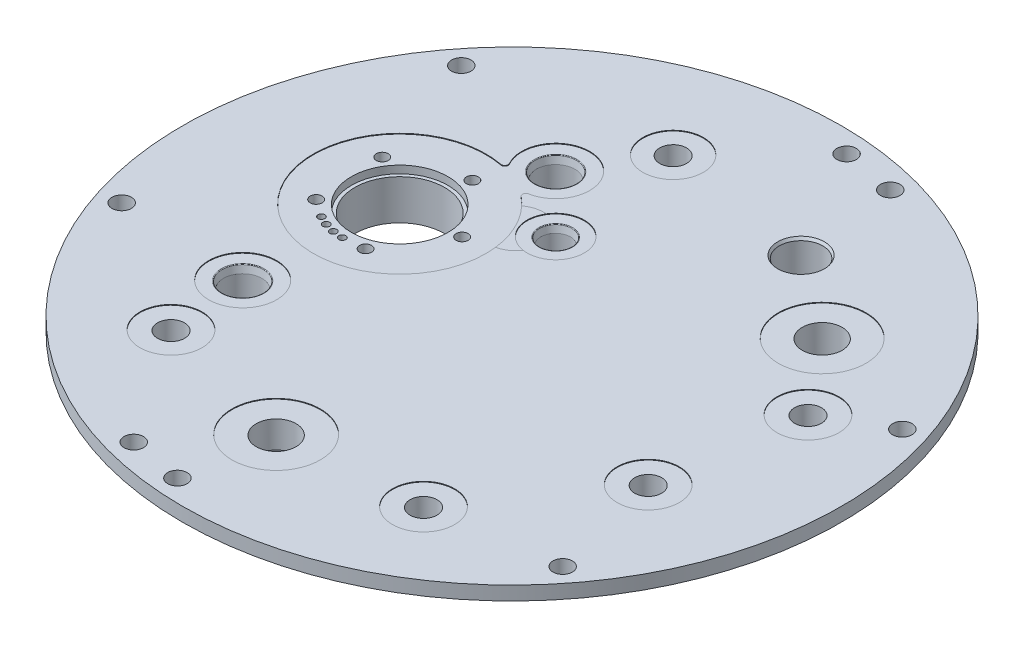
ISO-10303-21;
HEADER;
FILE_DESCRIPTION(('STEP AP214'),'2;1');
FILE_NAME('part.step','',(''),(''),'','','');
FILE_SCHEMA(('AUTOMOTIVE_DESIGN { 1 0 10303 214 1 1 1 1 }'));
ENDSEC;
DATA;
#1=APPLICATION_CONTEXT('core data for automotive mechanical design processes');
#2=APPLICATION_PROTOCOL_DEFINITION('international standard','automotive_design',2000,#1);
#3=PRODUCT_CONTEXT('',#1,'mechanical');
#4=PRODUCT('Part','Part','',(#3));
#5=PRODUCT_RELATED_PRODUCT_CATEGORY('part','',(#4));
#6=PRODUCT_DEFINITION_FORMATION('','',#4);
#7=PRODUCT_DEFINITION_CONTEXT('part definition',#1,'design');
#8=PRODUCT_DEFINITION('design','',#6,#7);
#9=PRODUCT_DEFINITION_SHAPE('','',#8);
#10=(LENGTH_UNIT() NAMED_UNIT(*) SI_UNIT(.MILLI.,.METRE.));
#11=(NAMED_UNIT(*) PLANE_ANGLE_UNIT() SI_UNIT($,.RADIAN.));
#12=(NAMED_UNIT(*) SI_UNIT($,.STERADIAN.) SOLID_ANGLE_UNIT());
#13=UNCERTAINTY_MEASURE_WITH_UNIT(LENGTH_MEASURE(1.E-05),#10,'distance_accuracy_value','');
#14=(GEOMETRIC_REPRESENTATION_CONTEXT(3) GLOBAL_UNCERTAINTY_ASSIGNED_CONTEXT((#13)) GLOBAL_UNIT_ASSIGNED_CONTEXT((#10,
#11,#12)) REPRESENTATION_CONTEXT('',''));
#15=CARTESIAN_POINT('',(0.,0.,0.));
#16=DIRECTION('',(0.,0.,1.));
#17=DIRECTION('',(1.,0.,0.));
#18=AXIS2_PLACEMENT_3D('',#15,#16,#17);
#19=CARTESIAN_POINT('',(0.,5.08,0.));
#20=DIRECTION('',(0.,-1.,0.));
#21=DIRECTION('',(0.,0.,-1.));
#22=AXIS2_PLACEMENT_3D('',#19,#20,#21);
#23=PLANE('',#22);
#24=CARTESIAN_POINT('',(107.83538817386,5.08,-35.7327561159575));
#25=DIRECTION('',(0.,1.,0.));
#26=DIRECTION('',(0.,0.,1.));
#27=AXIS2_PLACEMENT_3D('',#24,#25,#26);
#28=CIRCLE('',#27,3.571875);
#29=CARTESIAN_POINT('',(107.83538817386,5.08,-32.1608811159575));
#30=VERTEX_POINT('',#29);
#31=EDGE_CURVE('E393',#30,#30,#28,.T.);
#32=ORIENTED_EDGE('',*,*,#31,.F.);
#33=EDGE_LOOP('',(#32));
#34=FACE_BOUND('',#33,.T.);
#35=CARTESIAN_POINT('',(85.8708059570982,5.08,-23.0090131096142));
#36=DIRECTION('',(0.,1.,0.));
#37=DIRECTION('',(0.,0.,1.));
#38=AXIS2_PLACEMENT_3D('',#35,#36,#37);
#39=CIRCLE('',#38,11.43);
#40=CARTESIAN_POINT('',(85.8708059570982,5.08,-11.5790131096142));
#41=VERTEX_POINT('',#40);
#42=EDGE_CURVE('E377',#41,#41,#39,.T.);
#43=ORIENTED_EDGE('',*,*,#42,.F.);
#44=EDGE_LOOP('',(#43));
#45=FACE_BOUND('',#44,.T.);
#46=CARTESIAN_POINT('',(-58.3236476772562,5.08,67.0936816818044));
#47=DIRECTION('',(0.,1.,0.));
#48=DIRECTION('',(0.,0.,1.));
#49=AXIS2_PLACEMENT_3D('',#46,#47,#48);
#50=CIRCLE('',#49,11.43);
#51=CARTESIAN_POINT('',(-58.3236476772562,5.08,78.5236816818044));
#52=VERTEX_POINT('',#51);
#53=EDGE_CURVE('E432',#52,#52,#50,.T.);
#54=ORIENTED_EDGE('',*,*,#53,.F.);
#55=EDGE_LOOP('',(#54));
#56=FACE_BOUND('',#55,.T.);
#57=CARTESIAN_POINT('',(44.4500000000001,5.08,76.9896583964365));
#58=DIRECTION('',(0.,1.,0.));
#59=DIRECTION('',(0.,0.,1.));
#60=AXIS2_PLACEMENT_3D('',#57,#58,#59);
#61=CIRCLE('',#60,11.43);
#62=CARTESIAN_POINT('',(44.4500000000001,5.08,88.4196583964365));
#63=VERTEX_POINT('',#62);
#64=EDGE_CURVE('E438',#63,#63,#61,.T.);
#65=ORIENTED_EDGE('',*,*,#64,.F.);
#66=EDGE_LOOP('',(#65));
#67=FACE_BOUND('',#66,.T.);
#68=CARTESIAN_POINT('',(0.,5.08,0.));
#69=DIRECTION('',(0.,-1.,0.));
#70=DIRECTION('',(0.,0.,-1.));
#71=AXIS2_PLACEMENT_3D('',#68,#69,#70);
#72=CIRCLE('',#71,121.221499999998);
#73=CARTESIAN_POINT('',(0.,5.08,-121.221499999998));
#74=VERTEX_POINT('',#73);
#75=EDGE_CURVE('E309',#74,#74,#72,.T.);
#76=ORIENTED_EDGE('',*,*,#75,.F.);
#77=EDGE_LOOP('',(#76));
#78=FACE_BOUND('',#77,.T.);
#79=CARTESIAN_POINT('',(-60.96,5.07999999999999,38.1));
#80=DIRECTION('',(0.,1.,0.));
#81=DIRECTION('',(0.,0.,1.));
#82=AXIS2_PLACEMENT_3D('',#79,#80,#81);
#83=CIRCLE('',#82,12.5);
#84=CARTESIAN_POINT('',(-60.96,5.07999999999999,50.6));
#85=VERTEX_POINT('',#84);
#86=EDGE_CURVE('E161',#85,#85,#83,.T.);
#87=ORIENTED_EDGE('',*,*,#86,.F.);
#88=EDGE_LOOP('',(#87));
#89=FACE_BOUND('',#88,.T.);
#90=CARTESIAN_POINT('',(33.8136871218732,5.07999999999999,-72.5136860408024));
#91=DIRECTION('',(0.,-1.,0.));
#92=DIRECTION('',(0.,0.,-1.));
#93=AXIS2_PLACEMENT_3D('',#90,#91,#92);
#94=CIRCLE('',#93,8.606588);
#95=CARTESIAN_POINT('',(33.8136871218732,5.07999999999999,-81.1202740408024));
#96=VERTEX_POINT('',#95);
#97=EDGE_CURVE('E122',#96,#96,#94,.T.);
#98=ORIENTED_EDGE('',*,*,#97,.T.);
#99=EDGE_LOOP('',(#98));
#100=FACE_BOUND('',#99,.T.);
#101=CARTESIAN_POINT('',(-5.6698061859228,5.08,81.0820060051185));
#102=DIRECTION('',(0.,1.,0.));
#103=DIRECTION('',(0.,0.,1.));
#104=AXIS2_PLACEMENT_3D('',#101,#102,#103);
#105=CIRCLE('',#104,16.256);
#106=CARTESIAN_POINT('',(-5.6698061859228,5.08,97.3380060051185));
#107=VERTEX_POINT('',#106);
#108=EDGE_CURVE('E461',#107,#107,#105,.T.);
#109=ORIENTED_EDGE('',*,*,#108,.F.);
#110=EDGE_LOOP('',(#109));
#111=FACE_BOUND('',#110,.T.);
#112=CARTESIAN_POINT('',(64.0495140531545,5.08,-50.0409647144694));
#113=DIRECTION('',(0.,1.,0.));
#114=DIRECTION('',(0.,0.,1.));
#115=AXIS2_PLACEMENT_3D('',#112,#113,#114);
#116=CIRCLE('',#115,16.129);
#117=CARTESIAN_POINT('',(64.0495140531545,5.08,-33.9119647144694));
#118=VERTEX_POINT('',#117);
#119=EDGE_CURVE('E368',#118,#118,#116,.T.);
#120=ORIENTED_EDGE('',*,*,#119,.F.);
#121=EDGE_LOOP('',(#120));
#122=FACE_BOUND('',#121,.T.);
#123=CARTESIAN_POINT('',(78.7650354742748,5.08,28.6681284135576));
#124=DIRECTION('',(0.,1.,0.));
#125=DIRECTION('',(0.,0.,1.));
#126=AXIS2_PLACEMENT_3D('',#123,#124,#125);
#127=CIRCLE('',#126,11.43);
#128=CARTESIAN_POINT('',(78.7650354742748,5.08,40.0981284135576));
#129=VERTEX_POINT('',#128);
#130=EDGE_CURVE('E444',#129,#129,#127,.T.);
#131=ORIENTED_EDGE('',*,*,#130,.F.);
#132=EDGE_LOOP('',(#131));
#133=FACE_BOUND('',#132,.T.);
#134=CARTESIAN_POINT('',(89.1107961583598,5.08,70.45968216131));
#135=DIRECTION('',(0.,1.,0.));
#136=DIRECTION('',(0.,0.,1.));
#137=AXIS2_PLACEMENT_3D('',#134,#135,#136);
#138=CIRCLE('',#137,3.571875);
#139=CARTESIAN_POINT('',(89.1107961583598,5.08,74.03155716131));
#140=VERTEX_POINT('',#139);
#141=EDGE_CURVE('E394',#140,#140,#138,.T.);
#142=ORIENTED_EDGE('',*,*,#141,.F.);
#143=EDGE_LOOP('',(#142));
#144=FACE_BOUND('',#143,.T.);
#145=CARTESIAN_POINT('',(-9.90102310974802,5.08,113.169211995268));
#146=DIRECTION('',(0.,1.,0.));
#147=DIRECTION('',(0.,0.,1.));
#148=AXIS2_PLACEMENT_3D('',#145,#146,#147);
#149=CIRCLE('',#148,3.571875);
#150=CARTESIAN_POINT('',(-9.90102310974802,5.08,116.741086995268));
#151=VERTEX_POINT('',#150);
#152=EDGE_CURVE('E413',#151,#151,#149,.T.);
#153=ORIENTED_EDGE('',*,*,#152,.F.);
#154=EDGE_LOOP('',(#153));
#155=FACE_BOUND('',#154,.T.);
#156=CARTESIAN_POINT('',(-29.4022317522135,5.08,109.730622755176));
#157=DIRECTION('',(0.,1.,0.));
#158=DIRECTION('',(0.,0.,1.));
#159=AXIS2_PLACEMENT_3D('',#156,#157,#158);
#160=CIRCLE('',#159,3.571875);
#161=CARTESIAN_POINT('',(-29.4022317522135,5.08,113.302497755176));
#162=VERTEX_POINT('',#161);
#163=EDGE_CURVE('E492',#162,#162,#160,.T.);
#164=ORIENTED_EDGE('',*,*,#163,.F.);
#165=EDGE_LOOP('',(#164));
#166=FACE_BOUND('',#165,.T.);
#167=CARTESIAN_POINT('',(-107.83538817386,5.08,35.7327561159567));
#168=DIRECTION('',(0.,1.,0.));
#169=DIRECTION('',(0.,0.,1.));
#170=AXIS2_PLACEMENT_3D('',#167,#168,#169);
#171=CIRCLE('',#170,3.571875);
#172=CARTESIAN_POINT('',(-107.83538817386,5.08,39.3046311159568));
#173=VERTEX_POINT('',#172);
#174=EDGE_CURVE('E496',#173,#173,#171,.T.);
#175=ORIENTED_EDGE('',*,*,#174,.F.);
#176=EDGE_LOOP('',(#175));
#177=FACE_BOUND('',#176,.T.);
#178=CARTESIAN_POINT('',(-89.1107961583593,5.08,-70.4596821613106));
#179=DIRECTION('',(0.,1.,0.));
#180=DIRECTION('',(0.,0.,1.));
#181=AXIS2_PLACEMENT_3D('',#178,#179,#180);
#182=CIRCLE('',#181,3.571875);
#183=CARTESIAN_POINT('',(-89.1107961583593,5.08,-66.8878071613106));
#184=VERTEX_POINT('',#183);
#185=EDGE_CURVE('E500',#184,#184,#182,.T.);
#186=ORIENTED_EDGE('',*,*,#185,.F.);
#187=EDGE_LOOP('',(#186));
#188=FACE_BOUND('',#187,.T.);
#189=CARTESIAN_POINT('',(9.90102310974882,5.08,-113.169211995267));
#190=DIRECTION('',(0.,1.,0.));
#191=DIRECTION('',(0.,0.,1.));
#192=AXIS2_PLACEMENT_3D('',#189,#190,#191);
#193=CIRCLE('',#192,3.571875);
#194=CARTESIAN_POINT('',(9.90102310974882,5.08,-109.597336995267));
#195=VERTEX_POINT('',#194);
#196=EDGE_CURVE('E504',#195,#195,#193,.T.);
#197=ORIENTED_EDGE('',*,*,#196,.F.);
#198=EDGE_LOOP('',(#197));
#199=FACE_BOUND('',#198,.T.);
#200=CARTESIAN_POINT('',(29.4022317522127,5.08,-109.730622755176));
#201=DIRECTION('',(0.,1.,0.));
#202=DIRECTION('',(0.,0.,1.));
#203=AXIS2_PLACEMENT_3D('',#200,#201,#202);
#204=CIRCLE('',#203,3.571875);
#205=CARTESIAN_POINT('',(29.4022317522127,5.08,-106.158747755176));
#206=VERTEX_POINT('',#205);
#207=EDGE_CURVE('E508',#206,#206,#204,.T.);
#208=ORIENTED_EDGE('',*,*,#207,.F.);
#209=EDGE_LOOP('',(#208));
#210=FACE_BOUND('',#209,.T.);
#211=CARTESIAN_POINT('',(-21.6942123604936,5.08,-80.9639027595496));
#212=DIRECTION('',(0.,1.,0.));
#213=DIRECTION('',(0.,0.,1.));
#214=AXIS2_PLACEMENT_3D('',#211,#212,#213);
#215=CIRCLE('',#214,11.1252);
#216=CARTESIAN_POINT('',(-21.6942123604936,5.08,-69.8387027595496));
#217=VERTEX_POINT('',#216);
#218=EDGE_CURVE('E511',#217,#217,#215,.T.);
#219=ORIENTED_EDGE('',*,*,#218,.F.);
#220=EDGE_LOOP('',(#219));
#221=FACE_BOUND('',#220,.T.);
#222=CARTESIAN_POINT('',(-27.232681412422,5.08,-28.7348559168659));
#223=DIRECTION('',(0.,-1.,0.));
#224=DIRECTION('',(0.,0.,-1.));
#225=AXIS2_PLACEMENT_3D('',#222,#223,#224);
#226=CIRCLE('',#225,10.16);
#227=CARTESIAN_POINT('',(-24.8988157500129,5.08,-18.8465460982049));
#228=VERTEX_POINT('',#227);
#229=CARTESIAN_POINT('',(-18.8558790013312,5.08,-22.9855271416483));
#230=VERTEX_POINT('',#229);
#231=EDGE_CURVE('E12',#228,#230,#226,.F.);
#232=ORIENTED_EDGE('',*,*,#231,.F.);
#233=CARTESIAN_POINT('',(-56.4293867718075,5.08,-15.1202086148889));
#234=DIRECTION('',(0.,1.,0.));
#235=DIRECTION('',(0.,0.,1.));
#236=AXIS2_PLACEMENT_3D('',#233,#234,#235);
#237=CIRCLE('',#236,31.75);
#238=CARTESIAN_POINT('',(-50.4468571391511,5.08,-46.3014824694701));
#239=VERTEX_POINT('',#238);
#240=EDGE_CURVE('E256',#239,#228,#237,.T.);
#241=ORIENTED_EDGE('',*,*,#240,.F.);
#242=CARTESIAN_POINT('',(-50.2075559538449,5.08,-47.5487334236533));
#243=DIRECTION('',(0.,-1.,0.));
#244=DIRECTION('',(0.,0.,-1.));
#245=AXIS2_PLACEMENT_3D('',#242,#243,#244);
#246=CIRCLE('',#245,1.27);
#247=CARTESIAN_POINT('',(-49.0983280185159,5.08,-48.167210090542));
#248=VERTEX_POINT('',#247);
#249=EDGE_CURVE('E351',#239,#248,#246,.F.);
#250=ORIENTED_EDGE('',*,*,#249,.T.);
#251=CARTESIAN_POINT('',(-38.1807302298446,5.08,-54.2545788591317));
#252=DIRECTION('',(0.,1.,0.));
#253=DIRECTION('',(0.,0.,1.));
#254=AXIS2_PLACEMENT_3D('',#251,#252,#253);
#255=CIRCLE('',#254,12.5);
#256=CARTESIAN_POINT('',(-35.8262286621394,5.08,-41.9783285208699));
#257=VERTEX_POINT('',#256);
#258=EDGE_CURVE('E212',#257,#248,#255,.T.);
#259=ORIENTED_EDGE('',*,*,#258,.F.);
#260=CARTESIAN_POINT('',(-35.5870113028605,5.08,-40.7310614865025));
#261=DIRECTION('',(0.,-1.,0.));
#262=DIRECTION('',(0.,0.,-1.));
#263=AXIS2_PLACEMENT_3D('',#260,#261,#262);
#264=CIRCLE('',#263,1.27);
#265=CARTESIAN_POINT('',(-36.3886411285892,5.08,-39.7460286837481));
#266=VERTEX_POINT('',#265);
#267=EDGE_CURVE('E348',#257,#266,#264,.F.);
#268=ORIENTED_EDGE('',*,*,#267,.T.);
#269=CARTESIAN_POINT('',(-33.3073862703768,5.08,-36.8787837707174));
#270=VERTEX_POINT('',#269);
#271=EDGE_CURVE('E260',#270,#266,#237,.T.);
#272=ORIENTED_EDGE('',*,*,#271,.F.);
#273=CARTESIAN_POINT('',(-27.232681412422,5.08,-28.7348559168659));
#274=DIRECTION('',(0.,-1.,0.));
#275=DIRECTION('',(0.,0.,-1.));
#276=AXIS2_PLACEMENT_3D('',#273,#274,#275);
#277=CIRCLE('',#276,10.16);
#278=CARTESIAN_POINT('',(-26.2524179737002,5.08,-38.8474561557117));
#279=VERTEX_POINT('',#278);
#280=EDGE_CURVE('E52',#279,#270,#277,.F.);
#281=ORIENTED_EDGE('',*,*,#280,.F.);
#282=CARTESIAN_POINT('',(-17.2950165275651,5.08,-33.3688651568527));
#283=DIRECTION('',(0.,1.,0.));
#284=DIRECTION('',(0.,0.,1.));
#285=AXIS2_PLACEMENT_3D('',#282,#283,#284);
#286=CIRCLE('',#285,10.5);
#287=EDGE_CURVE('E186',#230,#279,#286,.T.);
#288=ORIENTED_EDGE('',*,*,#287,.F.);
#289=EDGE_LOOP('',(#232,#241,#250,#259,#268,#272,#281,#288));
#290=FACE_BOUND('',#289,.T.);
#291=ADVANCED_FACE('F43',(#34,#45,#56,#67,#78,#89,#100,#111,#122,#133,#144,#155,#166,#177,#188,
#199,#210,#221,#290),#23,.F.);
#292=EDGE_CURVE('E259',#228,#270,#237,.T.);
#293=ORIENTED_EDGE('',*,*,#292,.F.);
#294=ORIENTED_EDGE('',*,*,#231,.T.);
#295=EDGE_CURVE('E187',#279,#230,#286,.T.);
#296=ORIENTED_EDGE('',*,*,#295,.F.);
#297=ORIENTED_EDGE('',*,*,#280,.T.);
#298=EDGE_LOOP('',(#293,#294,#296,#297));
#299=FACE_BOUND('',#298,.T.);
#300=ADVANCED_FACE('F478',(#299),#23,.F.);
#301=CARTESIAN_POINT('',(-101.897309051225,-12.7,0.));
#302=DIRECTION('',(0.,1.,0.));
#303=DIRECTION('',(0.,0.,1.));
#304=AXIS2_PLACEMENT_3D('',#301,#302,#303);
#305=PLANE('',#304);
#306=CARTESIAN_POINT('',(-21.6942123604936,-12.7,-80.9639027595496));
#307=DIRECTION('',(0.,1.,0.));
#308=DIRECTION('',(0.,0.,1.));
#309=AXIS2_PLACEMENT_3D('',#306,#307,#308);
#310=CIRCLE('',#309,4.96061999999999);
#311=CARTESIAN_POINT('',(-21.6942123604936,-12.7,-76.0032827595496));
#312=VERTEX_POINT('',#311);
#313=EDGE_CURVE('E521',#312,#312,#310,.T.);
#314=ORIENTED_EDGE('',*,*,#313,.T.);
#315=EDGE_LOOP('',(#314));
#316=FACE_BOUND('',#315,.T.);
#317=CARTESIAN_POINT('',(-58.3236476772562,-12.7,67.0936816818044));
#318=DIRECTION('',(0.,1.,0.));
#319=DIRECTION('',(0.,0.,1.));
#320=AXIS2_PLACEMENT_3D('',#317,#318,#319);
#321=CIRCLE('',#320,4.96062);
#322=CARTESIAN_POINT('',(-58.3236476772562,-12.7,72.0543016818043));
#323=VERTEX_POINT('',#322);
#324=EDGE_CURVE('E390',#323,#323,#321,.T.);
#325=ORIENTED_EDGE('',*,*,#324,.T.);
#326=EDGE_LOOP('',(#325));
#327=FACE_BOUND('',#326,.T.);
#328=CARTESIAN_POINT('',(44.4500000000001,-12.7,76.9896583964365));
#329=DIRECTION('',(0.,1.,0.));
#330=DIRECTION('',(0.,0.,1.));
#331=AXIS2_PLACEMENT_3D('',#328,#329,#330);
#332=CIRCLE('',#331,4.96062);
#333=CARTESIAN_POINT('',(44.4500000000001,-12.7,81.9502783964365));
#334=VERTEX_POINT('',#333);
#335=EDGE_CURVE('E386',#334,#334,#332,.T.);
#336=ORIENTED_EDGE('',*,*,#335,.T.);
#337=EDGE_LOOP('',(#336));
#338=FACE_BOUND('',#337,.T.);
#339=CARTESIAN_POINT('',(78.7650354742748,-12.7,28.6681284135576));
#340=DIRECTION('',(0.,1.,0.));
#341=DIRECTION('',(0.,0.,1.));
#342=AXIS2_PLACEMENT_3D('',#339,#340,#341);
#343=CIRCLE('',#342,4.96062);
#344=CARTESIAN_POINT('',(78.7650354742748,-12.7,33.6287484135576));
#345=VERTEX_POINT('',#344);
#346=EDGE_CURVE('E382',#345,#345,#343,.T.);
#347=ORIENTED_EDGE('',*,*,#346,.T.);
#348=EDGE_LOOP('',(#347));
#349=FACE_BOUND('',#348,.T.);
#350=CARTESIAN_POINT('',(85.8708059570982,-12.7,-23.0090131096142));
#351=DIRECTION('',(0.,1.,0.));
#352=DIRECTION('',(0.,0.,1.));
#353=AXIS2_PLACEMENT_3D('',#350,#351,#352);
#354=CIRCLE('',#353,4.96062);
#355=CARTESIAN_POINT('',(85.8708059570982,-12.7,-18.0483931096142));
#356=VERTEX_POINT('',#355);
#357=EDGE_CURVE('E378',#356,#356,#354,.T.);
#358=ORIENTED_EDGE('',*,*,#357,.T.);
#359=EDGE_LOOP('',(#358));
#360=FACE_BOUND('',#359,.T.);
#361=CARTESIAN_POINT('',(-5.6698061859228,-12.7,81.0820060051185));
#362=DIRECTION('',(0.,-1.,0.));
#363=DIRECTION('',(0.,0.,-1.));
#364=AXIS2_PLACEMENT_3D('',#361,#362,#363);
#365=CIRCLE('',#364,14.2875);
#366=CARTESIAN_POINT('',(-5.6698061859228,-12.7,66.7945060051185));
#367=VERTEX_POINT('',#366);
#368=EDGE_CURVE('E450',#367,#367,#365,.T.);
#369=ORIENTED_EDGE('',*,*,#368,.F.);
#370=EDGE_LOOP('',(#369));
#371=FACE_BOUND('',#370,.T.);
#372=CARTESIAN_POINT('',(64.0495140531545,-12.7,-50.0409647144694));
#373=DIRECTION('',(0.,1.,0.));
#374=DIRECTION('',(0.,0.,1.));
#375=AXIS2_PLACEMENT_3D('',#372,#373,#374);
#376=CIRCLE('',#375,7.34186999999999);
#377=CARTESIAN_POINT('',(64.0495140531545,-12.7,-42.6990947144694));
#378=VERTEX_POINT('',#377);
#379=EDGE_CURVE('E367',#378,#378,#376,.T.);
#380=ORIENTED_EDGE('',*,*,#379,.T.);
#381=EDGE_LOOP('',(#380));
#382=FACE_BOUND('',#381,.T.);
#383=CARTESIAN_POINT('',(8.41368712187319,-12.7,-72.5136860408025));
#384=DIRECTION('',(0.,-1.,0.));
#385=DIRECTION('',(0.,0.,-1.));
#386=AXIS2_PLACEMENT_3D('',#383,#384,#385);
#387=CIRCLE('',#386,1.13029999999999);
#388=CARTESIAN_POINT('',(8.41368712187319,-12.7,-73.6439860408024));
#389=VERTEX_POINT('',#388);
#390=EDGE_CURVE('E110',#389,#389,#387,.T.);
#391=ORIENTED_EDGE('',*,*,#390,.F.);
#392=EDGE_LOOP('',(#391));
#393=FACE_BOUND('',#392,.T.);
#394=CARTESIAN_POINT('',(59.2136871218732,-12.7,-72.5136860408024));
#395=DIRECTION('',(0.,-1.,0.));
#396=DIRECTION('',(0.,0.,-1.));
#397=AXIS2_PLACEMENT_3D('',#394,#395,#396);
#398=CIRCLE('',#397,1.13029999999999);
#399=CARTESIAN_POINT('',(59.2136871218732,-12.7,-73.6439860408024));
#400=VERTEX_POINT('',#399);
#401=EDGE_CURVE('E109',#400,#400,#398,.T.);
#402=ORIENTED_EDGE('',*,*,#401,.F.);
#403=EDGE_LOOP('',(#402));
#404=FACE_BOUND('',#403,.T.);
#405=CARTESIAN_POINT('',(0.,-12.7,0.));
#406=DIRECTION('',(0.,-1.,0.));
#407=DIRECTION('',(0.,0.,-1.));
#408=AXIS2_PLACEMENT_3D('',#405,#406,#407);
#409=CIRCLE('',#408,101.897309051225);
#410=CARTESIAN_POINT('',(0.,-12.7,-101.897309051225));
#411=VERTEX_POINT('',#410);
#412=EDGE_CURVE('E294',#411,#411,#409,.T.);
#413=ORIENTED_EDGE('',*,*,#412,.T.);
#414=EDGE_LOOP('',(#413));
#415=FACE_BOUND('',#414,.T.);
#416=CARTESIAN_POINT('',(-56.4293867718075,-12.7,-15.1202086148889));
#417=DIRECTION('',(0.,1.,0.));
#418=DIRECTION('',(0.,0.,1.));
#419=AXIS2_PLACEMENT_3D('',#416,#417,#418);
#420=CIRCLE('',#419,16.51);
#421=CARTESIAN_POINT('',(-56.4293867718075,-12.7,1.38979138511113));
#422=VERTEX_POINT('',#421);
#423=EDGE_CURVE('E267',#422,#422,#420,.T.);
#424=ORIENTED_EDGE('',*,*,#423,.T.);
#425=EDGE_LOOP('',(#424));
#426=FACE_BOUND('',#425,.T.);
#427=CARTESIAN_POINT('',(-56.4293867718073,-12.7,5.96179138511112));
#428=DIRECTION('',(0.,1.,0.));
#429=DIRECTION('',(0.,0.,1.));
#430=AXIS2_PLACEMENT_3D('',#427,#428,#429);
#431=CIRCLE('',#430,1.26999999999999);
#432=CARTESIAN_POINT('',(-56.4293867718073,-12.7,7.23179138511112));
#433=VERTEX_POINT('',#432);
#434=EDGE_CURVE('E248',#433,#433,#431,.T.);
#435=ORIENTED_EDGE('',*,*,#434,.T.);
#436=EDGE_LOOP('',(#435));
#437=FACE_BOUND('',#436,.T.);
#438=CARTESIAN_POINT('',(-60.0902376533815,-12.7,5.64150843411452));
#439=DIRECTION('',(0.,1.,0.));
#440=DIRECTION('',(0.,0.,1.));
#441=AXIS2_PLACEMENT_3D('',#438,#439,#440);
#442=CIRCLE('',#441,1.26999999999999);
#443=CARTESIAN_POINT('',(-60.0902376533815,-12.7,6.91150843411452));
#444=VERTEX_POINT('',#443);
#445=EDGE_CURVE('E244',#444,#444,#442,.T.);
#446=ORIENTED_EDGE('',*,*,#445,.T.);
#447=EDGE_LOOP('',(#446));
#448=FACE_BOUND('',#447,.T.);
#449=CARTESIAN_POINT('',(-63.6398554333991,-12.7,4.69039121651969));
#450=DIRECTION('',(0.,1.,0.));
#451=DIRECTION('',(0.,0.,1.));
#452=AXIS2_PLACEMENT_3D('',#449,#450,#451);
#453=CIRCLE('',#452,1.26999999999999);
#454=CARTESIAN_POINT('',(-63.6398554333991,-12.7,5.96039121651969));
#455=VERTEX_POINT('',#454);
#456=EDGE_CURVE('E240',#455,#455,#453,.T.);
#457=ORIENTED_EDGE('',*,*,#456,.T.);
#458=EDGE_LOOP('',(#457));
#459=FACE_BOUND('',#458,.T.);
#460=CARTESIAN_POINT('',(-66.9703867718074,-12.7,3.13733894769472));
#461=DIRECTION('',(0.,1.,0.));
#462=DIRECTION('',(0.,0.,1.));
#463=AXIS2_PLACEMENT_3D('',#460,#461,#462);
#464=CIRCLE('',#463,1.26999999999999);
#465=CARTESIAN_POINT('',(-66.9703867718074,-12.7,4.40733894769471));
#466=VERTEX_POINT('',#465);
#467=EDGE_CURVE('E236',#466,#466,#464,.T.);
#468=ORIENTED_EDGE('',*,*,#467,.T.);
#469=EDGE_LOOP('',(#468));
#470=FACE_BOUND('',#469,.T.);
#471=CARTESIAN_POINT('',(-34.6153232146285,-12.7,-16.2634352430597));
#472=DIRECTION('',(0.,1.,0.));
#473=DIRECTION('',(0.,0.,1.));
#474=AXIS2_PLACEMENT_3D('',#471,#472,#473);
#475=CIRCLE('',#474,2.19709999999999);
#476=CARTESIAN_POINT('',(-34.6153232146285,-12.7,-14.0663352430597));
#477=VERTEX_POINT('',#476);
#478=EDGE_CURVE('E232',#477,#477,#475,.T.);
#479=ORIENTED_EDGE('',*,*,#478,.T.);
#480=EDGE_LOOP('',(#479));
#481=FACE_BOUND('',#480,.T.);
#482=CARTESIAN_POINT('',(-48.60119728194,-12.7,5.27292222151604));
#483=DIRECTION('',(0.,1.,0.));
#484=DIRECTION('',(0.,0.,1.));
#485=AXIS2_PLACEMENT_3D('',#482,#483,#484);
#486=CIRCLE('',#485,2.19709999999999);
#487=CARTESIAN_POINT('',(-48.60119728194,-12.7,7.47002222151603));
#488=VERTEX_POINT('',#487);
#489=EDGE_CURVE('E228',#488,#488,#486,.T.);
#490=ORIENTED_EDGE('',*,*,#489,.T.);
#491=EDGE_LOOP('',(#490));
#492=FACE_BOUND('',#491,.T.);
#493=CARTESIAN_POINT('',(-73.4053631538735,-12.7,-1.37333399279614));
#494=DIRECTION('',(0.,1.,0.));
#495=DIRECTION('',(0.,0.,1.));
#496=AXIS2_PLACEMENT_3D('',#493,#494,#495);
#497=CIRCLE('',#496,2.19709999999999);
#498=CARTESIAN_POINT('',(-73.4053631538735,-12.7,0.823766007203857));
#499=VERTEX_POINT('',#498);
#500=EDGE_CURVE('E224',#499,#499,#497,.T.);
#501=ORIENTED_EDGE('',*,*,#500,.T.);
#502=EDGE_LOOP('',(#501));
#503=FACE_BOUND('',#502,.T.);
#504=CARTESIAN_POINT('',(-74.7493066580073,-12.7,-27.0173036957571));
#505=DIRECTION('',(0.,1.,0.));
#506=DIRECTION('',(0.,0.,1.));
#507=AXIS2_PLACEMENT_3D('',#504,#505,#506);
#508=CIRCLE('',#507,2.19709999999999);
#509=CARTESIAN_POINT('',(-74.7493066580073,-12.7,-24.8202036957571));
#510=VERTEX_POINT('',#509);
#511=EDGE_CURVE('E220',#510,#510,#508,.T.);
#512=ORIENTED_EDGE('',*,*,#511,.T.);
#513=EDGE_LOOP('',(#512));
#514=FACE_BOUND('',#513,.T.);
#515=CARTESIAN_POINT('',(-50.775743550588,-12.7,-36.2198923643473));
#516=DIRECTION('',(0.,1.,0.));
#517=DIRECTION('',(0.,0.,1.));
#518=AXIS2_PLACEMENT_3D('',#515,#516,#517);
#519=CIRCLE('',#518,2.19709999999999);
#520=CARTESIAN_POINT('',(-50.775743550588,-12.7,-34.0227923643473));
#521=VERTEX_POINT('',#520);
#522=EDGE_CURVE('E216',#521,#521,#519,.T.);
#523=ORIENTED_EDGE('',*,*,#522,.T.);
#524=EDGE_LOOP('',(#523));
#525=FACE_BOUND('',#524,.T.);
#526=CARTESIAN_POINT('',(-38.1807302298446,-12.7,-54.2545788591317));
#527=DIRECTION('',(0.,1.,0.));
#528=DIRECTION('',(0.,0.,1.));
#529=AXIS2_PLACEMENT_3D('',#526,#527,#528);
#530=CIRCLE('',#529,6.54811999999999);
#531=CARTESIAN_POINT('',(-38.1807302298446,-12.7,-47.7064588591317));
#532=VERTEX_POINT('',#531);
#533=EDGE_CURVE('E215',#532,#532,#530,.T.);
#534=ORIENTED_EDGE('',*,*,#533,.T.);
#535=EDGE_LOOP('',(#534));
#536=FACE_BOUND('',#535,.T.);
#537=CARTESIAN_POINT('',(-17.2950165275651,-12.7,-33.3688651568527));
#538=DIRECTION('',(0.,1.,0.));
#539=DIRECTION('',(0.,0.,1.));
#540=AXIS2_PLACEMENT_3D('',#537,#538,#539);
#541=CIRCLE('',#540,4.96062);
#542=CARTESIAN_POINT('',(-17.2950165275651,-12.7,-28.4082451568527));
#543=VERTEX_POINT('',#542);
#544=EDGE_CURVE('E190',#543,#543,#541,.T.);
#545=ORIENTED_EDGE('',*,*,#544,.T.);
#546=EDGE_LOOP('',(#545));
#547=FACE_BOUND('',#546,.T.);
#548=CARTESIAN_POINT('',(-60.96,-12.7,38.1));
#549=DIRECTION('',(0.,1.,0.));
#550=DIRECTION('',(0.,0.,1.));
#551=AXIS2_PLACEMENT_3D('',#548,#549,#550);
#552=CIRCLE('',#551,3.17628976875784);
#553=CARTESIAN_POINT('',(-60.96,-12.7,41.2762897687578));
#554=VERTEX_POINT('',#553);
#555=EDGE_CURVE('E164',#554,#554,#552,.T.);
#556=ORIENTED_EDGE('',*,*,#555,.T.);
#557=EDGE_LOOP('',(#556));
#558=FACE_BOUND('',#557,.T.);
#559=CARTESIAN_POINT('',(33.8136871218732,-12.7,-72.5136860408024));
#560=DIRECTION('',(0.,-1.,0.));
#561=DIRECTION('',(0.,0.,-1.));
#562=AXIS2_PLACEMENT_3D('',#559,#560,#561);
#563=CIRCLE('',#562,15.875);
#564=CARTESIAN_POINT('',(33.8136871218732,-12.7,-88.3886860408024));
#565=VERTEX_POINT('',#564);
#566=EDGE_CURVE('E125',#565,#565,#563,.T.);
#567=ORIENTED_EDGE('',*,*,#566,.F.);
#568=EDGE_LOOP('',(#567));
#569=FACE_BOUND('',#568,.T.);
#570=ADVANCED_FACE('F633',(#316,#327,#338,#349,#360,#371,#382,#393,#404,#415,#426,#437,#448,
#459,#470,#481,#492,#503,#514,#525,#536,#547,#558,#569),#305,.F.);
#571=CARTESIAN_POINT('',(-56.4293867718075,5.08,-15.1202086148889));
#572=DIRECTION('',(0.,1.,0.));
#573=DIRECTION('',(0.,0.,1.));
#574=AXIS2_PLACEMENT_3D('',#571,#572,#573);
#575=CYLINDRICAL_SURFACE('',#574,17.78);
#576=CARTESIAN_POINT('',(-56.4293867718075,2.032,-15.1202086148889));
#577=DIRECTION('',(0.,1.,0.));
#578=DIRECTION('',(0.,0.,1.));
#579=AXIS2_PLACEMENT_3D('',#576,#577,#578);
#580=CIRCLE('',#579,17.78);
#581=CARTESIAN_POINT('',(-56.4293867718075,2.032,2.65979138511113));
#582=VERTEX_POINT('',#581);
#583=EDGE_CURVE('E261',#582,#582,#580,.T.);
#584=ORIENTED_EDGE('',*,*,#583,.F.);
#585=EDGE_LOOP('',(#584));
#586=FACE_BOUND('',#585,.T.);
#587=CARTESIAN_POINT('',(-56.4293867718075,4.826,-15.1202086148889));
#588=DIRECTION('',(0.,1.,0.));
#589=DIRECTION('',(0.,0.,1.));
#590=AXIS2_PLACEMENT_3D('',#587,#588,#589);
#591=CIRCLE('',#590,17.78);
#592=CARTESIAN_POINT('',(-56.4293867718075,4.826,2.65979138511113));
#593=VERTEX_POINT('',#592);
#594=EDGE_CURVE('E255',#593,#593,#591,.F.);
#595=ORIENTED_EDGE('',*,*,#594,.F.);
#596=EDGE_LOOP('',(#595));
#597=FACE_BOUND('',#596,.T.);
#598=ADVANCED_FACE('F556',(#586,#597),#575,.F.);
#599=CARTESIAN_POINT('',(-121.221499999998,0.,0.));
#600=DIRECTION('',(0.,1.,0.));
#601=DIRECTION('',(0.,0.,1.));
#602=AXIS2_PLACEMENT_3D('',#599,#600,#601);
#603=PLANE('',#602);
#604=CARTESIAN_POINT('',(29.4022317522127,0.,-109.730622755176));
#605=DIRECTION('',(0.,1.,0.));
#606=DIRECTION('',(0.,0.,1.));
#607=AXIS2_PLACEMENT_3D('',#604,#605,#606);
#608=CIRCLE('',#607,3.571875);
#609=CARTESIAN_POINT('',(29.4022317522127,0.,-106.158747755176));
#610=VERTEX_POINT('',#609);
#611=EDGE_CURVE('E525',#610,#610,#608,.T.);
#612=ORIENTED_EDGE('',*,*,#611,.T.);
#613=EDGE_LOOP('',(#612));
#614=FACE_BOUND('',#613,.T.);
#615=CARTESIAN_POINT('',(9.90102310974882,0.,-113.169211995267));
#616=DIRECTION('',(0.,1.,0.));
#617=DIRECTION('',(0.,0.,1.));
#618=AXIS2_PLACEMENT_3D('',#615,#616,#617);
#619=CIRCLE('',#618,3.571875);
#620=CARTESIAN_POINT('',(9.90102310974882,0.,-109.597336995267));
#621=VERTEX_POINT('',#620);
#622=EDGE_CURVE('E529',#621,#621,#619,.T.);
#623=ORIENTED_EDGE('',*,*,#622,.T.);
#624=EDGE_LOOP('',(#623));
#625=FACE_BOUND('',#624,.T.);
#626=CARTESIAN_POINT('',(-89.1107961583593,0.,-70.4596821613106));
#627=DIRECTION('',(0.,1.,0.));
#628=DIRECTION('',(0.,0.,1.));
#629=AXIS2_PLACEMENT_3D('',#626,#627,#628);
#630=CIRCLE('',#629,3.571875);
#631=CARTESIAN_POINT('',(-89.1107961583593,0.,-66.8878071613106));
#632=VERTEX_POINT('',#631);
#633=EDGE_CURVE('E533',#632,#632,#630,.T.);
#634=ORIENTED_EDGE('',*,*,#633,.T.);
#635=EDGE_LOOP('',(#634));
#636=FACE_BOUND('',#635,.T.);
#637=CARTESIAN_POINT('',(-107.83538817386,0.,35.7327561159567));
#638=DIRECTION('',(0.,1.,0.));
#639=DIRECTION('',(0.,0.,1.));
#640=AXIS2_PLACEMENT_3D('',#637,#638,#639);
#641=CIRCLE('',#640,3.571875);
#642=CARTESIAN_POINT('',(-107.83538817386,0.,39.3046311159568));
#643=VERTEX_POINT('',#642);
#644=EDGE_CURVE('E537',#643,#643,#641,.T.);
#645=ORIENTED_EDGE('',*,*,#644,.T.);
#646=EDGE_LOOP('',(#645));
#647=FACE_BOUND('',#646,.T.);
#648=CARTESIAN_POINT('',(-29.4022317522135,0.,109.730622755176));
#649=DIRECTION('',(0.,1.,0.));
#650=DIRECTION('',(0.,0.,1.));
#651=AXIS2_PLACEMENT_3D('',#648,#649,#650);
#652=CIRCLE('',#651,3.571875);
#653=CARTESIAN_POINT('',(-29.4022317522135,0.,113.302497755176));
#654=VERTEX_POINT('',#653);
#655=EDGE_CURVE('E542',#654,#654,#652,.T.);
#656=ORIENTED_EDGE('',*,*,#655,.T.);
#657=EDGE_LOOP('',(#656));
#658=FACE_BOUND('',#657,.T.);
#659=CARTESIAN_POINT('',(-9.90102310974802,0.,113.169211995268));
#660=DIRECTION('',(0.,1.,0.));
#661=DIRECTION('',(0.,0.,1.));
#662=AXIS2_PLACEMENT_3D('',#659,#660,#661);
#663=CIRCLE('',#662,3.571875);
#664=CARTESIAN_POINT('',(-9.90102310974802,0.,116.741086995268));
#665=VERTEX_POINT('',#664);
#666=EDGE_CURVE('E408',#665,#665,#663,.T.);
#667=ORIENTED_EDGE('',*,*,#666,.T.);
#668=EDGE_LOOP('',(#667));
#669=FACE_BOUND('',#668,.T.);
#670=CARTESIAN_POINT('',(89.1107961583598,0.,70.45968216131));
#671=DIRECTION('',(0.,1.,0.));
#672=DIRECTION('',(0.,0.,1.));
#673=AXIS2_PLACEMENT_3D('',#670,#671,#672);
#674=CIRCLE('',#673,3.571875);
#675=CARTESIAN_POINT('',(89.1107961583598,0.,74.03155716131));
#676=VERTEX_POINT('',#675);
#677=EDGE_CURVE('E391',#676,#676,#674,.T.);
#678=ORIENTED_EDGE('',*,*,#677,.T.);
#679=EDGE_LOOP('',(#678));
#680=FACE_BOUND('',#679,.T.);
#681=CARTESIAN_POINT('',(107.83538817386,0.,-35.7327561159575));
#682=DIRECTION('',(0.,1.,0.));
#683=DIRECTION('',(0.,0.,1.));
#684=AXIS2_PLACEMENT_3D('',#681,#682,#683);
#685=CIRCLE('',#684,3.571875);
#686=CARTESIAN_POINT('',(107.83538817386,0.,-32.1608811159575));
#687=VERTEX_POINT('',#686);
#688=EDGE_CURVE('E405',#687,#687,#685,.T.);
#689=ORIENTED_EDGE('',*,*,#688,.T.);
#690=EDGE_LOOP('',(#689));
#691=FACE_BOUND('',#690,.T.);
#692=CARTESIAN_POINT('',(0.,0.,0.));
#693=DIRECTION('',(0.,-1.,0.));
#694=DIRECTION('',(0.,0.,-1.));
#695=AXIS2_PLACEMENT_3D('',#692,#693,#694);
#696=CIRCLE('',#695,121.221499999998);
#697=CARTESIAN_POINT('',(0.,0.,-121.221499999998));
#698=VERTEX_POINT('',#697);
#699=EDGE_CURVE('E305',#698,#698,#696,.T.);
#700=ORIENTED_EDGE('',*,*,#699,.T.);
#701=EDGE_LOOP('',(#700));
#702=FACE_BOUND('',#701,.T.);
#703=CARTESIAN_POINT('',(0.,0.,0.));
#704=DIRECTION('',(0.,1.,0.));
#705=DIRECTION('',(0.,0.,1.));
#706=AXIS2_PLACEMENT_3D('',#703,#704,#705);
#707=CIRCLE('',#706,104.4829);
#708=CARTESIAN_POINT('',(0.,0.,104.4829));
#709=VERTEX_POINT('',#708);
#710=EDGE_CURVE('E312',#709,#709,#707,.F.);
#711=ORIENTED_EDGE('',*,*,#710,.F.);
#712=EDGE_LOOP('',(#711));
#713=FACE_BOUND('',#712,.T.);
#714=ADVANCED_FACE('F553',(#614,#625,#636,#647,#658,#669,#680,#691,#702,#713),#603,.F.);
#715=CARTESIAN_POINT('',(0.,-18.420388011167,0.));
#716=DIRECTION('',(0.,-1.,0.));
#717=DIRECTION('',(0.,0.,-1.));
#718=AXIS2_PLACEMENT_3D('',#715,#716,#717);
#719=CYLINDRICAL_SURFACE('',#718,102.5779);
#720=CARTESIAN_POINT('',(0.,0.,0.));
#721=DIRECTION('',(0.,-1.,0.));
#722=DIRECTION('',(0.,0.,-1.));
#723=AXIS2_PLACEMENT_3D('',#720,#721,#722);
#724=CIRCLE('',#723,102.5779);
#725=CARTESIAN_POINT('',(0.,0.,-102.5779));
#726=VERTEX_POINT('',#725);
#727=EDGE_CURVE('E302',#726,#726,#724,.T.);
#728=ORIENTED_EDGE('',*,*,#727,.T.);
#729=EDGE_LOOP('',(#728));
#730=FACE_BOUND('',#729,.T.);
#731=CARTESIAN_POINT('',(0.,-3.81635000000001,0.));
#732=DIRECTION('',(0.,1.,0.));
#733=DIRECTION('',(0.,0.,1.));
#734=AXIS2_PLACEMENT_3D('',#731,#732,#733);
#735=CIRCLE('',#734,102.5779);
#736=CARTESIAN_POINT('',(0.,-3.81635000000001,102.5779));
#737=VERTEX_POINT('',#736);
#738=EDGE_CURVE('E291',#737,#737,#735,.T.);
#739=ORIENTED_EDGE('',*,*,#738,.T.);
#740=EDGE_LOOP('',(#739));
#741=FACE_BOUND('',#740,.T.);
#742=ADVANCED_FACE('F555',(#730,#741),#719,.T.);
#743=CARTESIAN_POINT('',(0.,-18.420388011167,0.));
#744=DIRECTION('',(0.,-1.,0.));
#745=DIRECTION('',(0.,0.,-1.));
#746=AXIS2_PLACEMENT_3D('',#743,#744,#745);
#747=CYLINDRICAL_SURFACE('',#746,121.221499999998);
#748=ORIENTED_EDGE('',*,*,#699,.F.);
#749=EDGE_LOOP('',(#748));
#750=FACE_BOUND('',#749,.T.);
#751=ORIENTED_EDGE('',*,*,#75,.T.);
#752=EDGE_LOOP('',(#751));
#753=FACE_BOUND('',#752,.T.);
#754=ADVANCED_FACE('F570',(#750,#753),#747,.T.);
#755=ORIENTED_EDGE('',*,*,#710,.T.);
#756=EDGE_LOOP('',(#755));
#757=FACE_BOUND('',#756,.T.);
#758=ORIENTED_EDGE('',*,*,#727,.F.);
#759=EDGE_LOOP('',(#758));
#760=FACE_BOUND('',#759,.T.);
#761=ADVANCED_FACE('F559',(#757,#760),#603,.F.);
#762=CARTESIAN_POINT('',(0.,-3.81635000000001,0.));
#763=DIRECTION('',(0.,1.,0.));
#764=DIRECTION('',(0.,0.,1.));
#765=AXIS2_PLACEMENT_3D('',#762,#763,#764);
#766=TOROIDAL_SURFACE('',#765,102.4509,0.127000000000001);
#767=ORIENTED_EDGE('',*,*,#738,.F.);
#768=EDGE_LOOP('',(#767));
#769=FACE_BOUND('',#768,.T.);
#770=CARTESIAN_POINT('',(0.,-3.94335000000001,0.));
#771=DIRECTION('',(0.,1.,0.));
#772=DIRECTION('',(0.,0.,1.));
#773=AXIS2_PLACEMENT_3D('',#770,#771,#772);
#774=CIRCLE('',#773,102.4509);
#775=CARTESIAN_POINT('',(0.,-3.94335000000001,102.4509));
#776=VERTEX_POINT('',#775);
#777=EDGE_CURVE('E270',#776,#776,#774,.T.);
#778=ORIENTED_EDGE('',*,*,#777,.T.);
#779=EDGE_LOOP('',(#778));
#780=FACE_BOUND('',#779,.T.);
#781=ADVANCED_FACE('F569',(#769,#780),#766,.T.);
#782=CARTESIAN_POINT('',(0.,-8.88365000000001,0.));
#783=DIRECTION('',(0.,1.,0.));
#784=DIRECTION('',(0.,0.,1.));
#785=AXIS2_PLACEMENT_3D('',#782,#783,#784);
#786=TOROIDAL_SURFACE('',#785,102.4509,0.127000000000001);
#787=CARTESIAN_POINT('',(0.,-8.75665000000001,0.));
#788=DIRECTION('',(0.,1.,0.));
#789=DIRECTION('',(0.,0.,1.));
#790=AXIS2_PLACEMENT_3D('',#787,#788,#789);
#791=CIRCLE('',#790,102.4509);
#792=CARTESIAN_POINT('',(0.,-8.75665000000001,102.4509));
#793=VERTEX_POINT('',#792);
#794=EDGE_CURVE('E285',#793,#793,#791,.T.);
#795=ORIENTED_EDGE('',*,*,#794,.F.);
#796=EDGE_LOOP('',(#795));
#797=FACE_BOUND('',#796,.T.);
#798=CARTESIAN_POINT('',(0.,-8.88365000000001,0.));
#799=DIRECTION('',(0.,1.,0.));
#800=DIRECTION('',(0.,0.,1.));
#801=AXIS2_PLACEMENT_3D('',#798,#799,#800);
#802=CIRCLE('',#801,102.5779);
#803=CARTESIAN_POINT('',(0.,-8.88365000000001,102.5779));
#804=VERTEX_POINT('',#803);
#805=EDGE_CURVE('E288',#804,#804,#802,.T.);
#806=ORIENTED_EDGE('',*,*,#805,.T.);
#807=EDGE_LOOP('',(#806));
#808=FACE_BOUND('',#807,.T.);
#809=ADVANCED_FACE('F581',(#797,#808),#786,.T.);
#810=CARTESIAN_POINT('',(-102.4509,-8.75665000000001,0.));
#811=DIRECTION('',(0.,-1.,0.));
#812=DIRECTION('',(0.,0.,-1.));
#813=AXIS2_PLACEMENT_3D('',#810,#811,#812);
#814=PLANE('',#813);
#815=CARTESIAN_POINT('',(0.,-8.75665000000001,0.));
#816=DIRECTION('',(0.,1.,0.));
#817=DIRECTION('',(0.,0.,1.));
#818=AXIS2_PLACEMENT_3D('',#815,#816,#817);
#819=CIRCLE('',#818,100.1776);
#820=CARTESIAN_POINT('',(0.,-8.75665000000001,100.1776));
#821=VERTEX_POINT('',#820);
#822=EDGE_CURVE('E282',#821,#821,#819,.T.);
#823=ORIENTED_EDGE('',*,*,#822,.F.);
#824=EDGE_LOOP('',(#823));
#825=FACE_BOUND('',#824,.T.);
#826=ORIENTED_EDGE('',*,*,#794,.T.);
#827=EDGE_LOOP('',(#826));
#828=FACE_BOUND('',#827,.T.);
#829=ADVANCED_FACE('F607',(#825,#828),#814,.F.);
#830=CARTESIAN_POINT('',(0.,-8.31215000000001,0.));
#831=DIRECTION('',(0.,1.,0.));
#832=DIRECTION('',(0.,0.,1.));
#833=AXIS2_PLACEMENT_3D('',#830,#831,#832);
#834=TOROIDAL_SURFACE('',#833,100.1776,0.444500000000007);
#835=CARTESIAN_POINT('',(0.,-8.31215000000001,0.));
#836=DIRECTION('',(0.,1.,0.));
#837=DIRECTION('',(0.,0.,1.));
#838=AXIS2_PLACEMENT_3D('',#835,#836,#837);
#839=CIRCLE('',#838,99.7331);
#840=CARTESIAN_POINT('',(0.,-8.31215000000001,99.7331));
#841=VERTEX_POINT('',#840);
#842=EDGE_CURVE('E279',#841,#841,#839,.T.);
#843=ORIENTED_EDGE('',*,*,#842,.F.);
#844=EDGE_LOOP('',(#843));
#845=FACE_BOUND('',#844,.T.);
#846=ORIENTED_EDGE('',*,*,#822,.T.);
#847=EDGE_LOOP('',(#846));
#848=FACE_BOUND('',#847,.T.);
#849=ADVANCED_FACE('F601',(#845,#848),#834,.F.);
#850=CARTESIAN_POINT('',(0.,0.,0.));
#851=DIRECTION('',(0.,1.,0.));
#852=DIRECTION('',(0.,0.,1.));
#853=AXIS2_PLACEMENT_3D('',#850,#851,#852);
#854=CYLINDRICAL_SURFACE('',#853,99.7331);
#855=CARTESIAN_POINT('',(0.,-4.38785000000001,0.));
#856=DIRECTION('',(0.,1.,0.));
#857=DIRECTION('',(0.,0.,1.));
#858=AXIS2_PLACEMENT_3D('',#855,#856,#857);
#859=CIRCLE('',#858,99.7331);
#860=CARTESIAN_POINT('',(0.,-4.38785000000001,99.7331));
#861=VERTEX_POINT('',#860);
#862=EDGE_CURVE('E276',#861,#861,#859,.T.);
#863=ORIENTED_EDGE('',*,*,#862,.F.);
#864=EDGE_LOOP('',(#863));
#865=FACE_BOUND('',#864,.T.);
#866=ORIENTED_EDGE('',*,*,#842,.T.);
#867=EDGE_LOOP('',(#866));
#868=FACE_BOUND('',#867,.T.);
#869=ADVANCED_FACE('F595',(#865,#868),#854,.T.);
#870=CARTESIAN_POINT('',(0.,-4.38785000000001,0.));
#871=DIRECTION('',(0.,1.,0.));
#872=DIRECTION('',(0.,0.,1.));
#873=AXIS2_PLACEMENT_3D('',#870,#871,#872);
#874=TOROIDAL_SURFACE('',#873,100.1776,0.444500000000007);
#875=CARTESIAN_POINT('',(0.,-3.94335,0.));
#876=DIRECTION('',(0.,1.,0.));
#877=DIRECTION('',(0.,0.,1.));
#878=AXIS2_PLACEMENT_3D('',#875,#876,#877);
#879=CIRCLE('',#878,100.1776);
#880=CARTESIAN_POINT('',(0.,-3.94335,100.1776));
#881=VERTEX_POINT('',#880);
#882=EDGE_CURVE('E273',#881,#881,#879,.T.);
#883=ORIENTED_EDGE('',*,*,#882,.F.);
#884=EDGE_LOOP('',(#883));
#885=FACE_BOUND('',#884,.T.);
#886=ORIENTED_EDGE('',*,*,#862,.T.);
#887=EDGE_LOOP('',(#886));
#888=FACE_BOUND('',#887,.T.);
#889=ADVANCED_FACE('F589',(#885,#888),#874,.F.);
#890=CARTESIAN_POINT('',(-102.4509,-3.94335000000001,0.));
#891=DIRECTION('',(0.,1.,0.));
#892=DIRECTION('',(0.,0.,1.));
#893=AXIS2_PLACEMENT_3D('',#890,#891,#892);
#894=PLANE('',#893);
#895=ORIENTED_EDGE('',*,*,#777,.F.);
#896=EDGE_LOOP('',(#895));
#897=FACE_BOUND('',#896,.T.);
#898=ORIENTED_EDGE('',*,*,#882,.T.);
#899=EDGE_LOOP('',(#898));
#900=FACE_BOUND('',#899,.T.);
#901=ADVANCED_FACE('F585',(#897,#900),#894,.F.);
#902=CARTESIAN_POINT('',(0.,-10.16,0.));
#903=DIRECTION('',(0.,1.,0.));
#904=DIRECTION('',(0.,0.,1.));
#905=AXIS2_PLACEMENT_3D('',#902,#903,#904);
#906=CONICAL_SURFACE('',#905,102.5779,0.26179938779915);
#907=ORIENTED_EDGE('',*,*,#412,.F.);
#908=EDGE_LOOP('',(#907));
#909=FACE_BOUND('',#908,.T.);
#910=CARTESIAN_POINT('',(0.,-10.16,0.));
#911=DIRECTION('',(0.,-1.,0.));
#912=DIRECTION('',(0.,0.,-1.));
#913=AXIS2_PLACEMENT_3D('',#910,#911,#912);
#914=CIRCLE('',#913,102.5779);
#915=CARTESIAN_POINT('',(0.,-10.16,-102.5779));
#916=VERTEX_POINT('',#915);
#917=EDGE_CURVE('E298',#916,#916,#914,.T.);
#918=ORIENTED_EDGE('',*,*,#917,.T.);
#919=EDGE_LOOP('',(#918));
#920=FACE_BOUND('',#919,.T.);
#921=ADVANCED_FACE('F588',(#909,#920),#906,.T.);
#922=ORIENTED_EDGE('',*,*,#805,.F.);
#923=EDGE_LOOP('',(#922));
#924=FACE_BOUND('',#923,.T.);
#925=ORIENTED_EDGE('',*,*,#917,.F.);
#926=EDGE_LOOP('',(#925));
#927=FACE_BOUND('',#926,.T.);
#928=ADVANCED_FACE('F576',(#924,#927),#719,.T.);
#929=CARTESIAN_POINT('',(-56.4293867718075,5.08,-15.1202086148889));
#930=DIRECTION('',(0.,1.,0.));
#931=DIRECTION('',(0.,0.,1.));
#932=AXIS2_PLACEMENT_3D('',#929,#930,#931);
#933=CYLINDRICAL_SURFACE('',#932,16.51);
#934=ORIENTED_EDGE('',*,*,#423,.F.);
#935=EDGE_LOOP('',(#934));
#936=FACE_BOUND('',#935,.T.);
#937=CARTESIAN_POINT('',(-56.4293867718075,2.032,-15.1202086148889));
#938=DIRECTION('',(0.,1.,0.));
#939=DIRECTION('',(0.,0.,1.));
#940=AXIS2_PLACEMENT_3D('',#937,#938,#939);
#941=CIRCLE('',#940,16.51);
#942=CARTESIAN_POINT('',(-56.4293867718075,2.032,1.38979138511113));
#943=VERTEX_POINT('',#942);
#944=EDGE_CURVE('E264',#943,#943,#941,.T.);
#945=ORIENTED_EDGE('',*,*,#944,.T.);
#946=EDGE_LOOP('',(#945));
#947=FACE_BOUND('',#946,.T.);
#948=ADVANCED_FACE('F623',(#936,#947),#933,.F.);
#949=CARTESIAN_POINT('',(-39.9193867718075,2.032,-15.1202086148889));
#950=DIRECTION('',(0.,-1.,0.));
#951=DIRECTION('',(0.,0.,-1.));
#952=AXIS2_PLACEMENT_3D('',#949,#950,#951);
#953=PLANE('',#952);
#954=ORIENTED_EDGE('',*,*,#944,.F.);
#955=EDGE_LOOP('',(#954));
#956=FACE_BOUND('',#955,.T.);
#957=ORIENTED_EDGE('',*,*,#583,.T.);
#958=EDGE_LOOP('',(#957));
#959=FACE_BOUND('',#958,.T.);
#960=ADVANCED_FACE('F752',(#956,#959),#953,.F.);
#961=CARTESIAN_POINT('',(-56.4293867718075,4.826,-15.1202086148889));
#962=DIRECTION('',(0.,1.,0.));
#963=DIRECTION('',(0.,0.,1.));
#964=AXIS2_PLACEMENT_3D('',#961,#962,#963);
#965=PLANE('',#964);
#966=CARTESIAN_POINT('',(-38.1807302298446,4.826,-54.2545788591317));
#967=DIRECTION('',(0.,1.,0.));
#968=DIRECTION('',(0.,0.,1.));
#969=AXIS2_PLACEMENT_3D('',#966,#967,#968);
#970=CIRCLE('',#969,12.5);
#971=CARTESIAN_POINT('',(-35.8262286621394,4.826,-41.9783285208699));
#972=VERTEX_POINT('',#971);
#973=CARTESIAN_POINT('',(-49.0983280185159,4.826,-48.167210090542));
#974=VERTEX_POINT('',#973);
#975=EDGE_CURVE('E209',#972,#974,#970,.T.);
#976=ORIENTED_EDGE('',*,*,#975,.T.);
#977=CARTESIAN_POINT('',(-50.2075559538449,4.826,-47.5487334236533));
#978=DIRECTION('',(0.,1.,0.));
#979=DIRECTION('',(0.,0.,1.));
#980=AXIS2_PLACEMENT_3D('',#977,#978,#979);
#981=CIRCLE('',#980,1.27);
#982=CARTESIAN_POINT('',(-50.4468571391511,4.826,-46.3014824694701));
#983=VERTEX_POINT('',#982);
#984=EDGE_CURVE('E357',#974,#983,#981,.F.);
#985=ORIENTED_EDGE('',*,*,#984,.T.);
#986=CARTESIAN_POINT('',(-56.4293867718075,4.826,-15.1202086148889));
#987=DIRECTION('',(0.,1.,0.));
#988=DIRECTION('',(0.,0.,1.));
#989=AXIS2_PLACEMENT_3D('',#986,#987,#988);
#990=CIRCLE('',#989,31.75);
#991=CARTESIAN_POINT('',(-36.3886411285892,4.826,-39.7460286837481));
#992=VERTEX_POINT('',#991);
#993=EDGE_CURVE('E252',#983,#992,#990,.T.);
#994=ORIENTED_EDGE('',*,*,#993,.T.);
#995=CARTESIAN_POINT('',(-35.5870113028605,4.826,-40.7310614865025));
#996=DIRECTION('',(0.,1.,0.));
#997=DIRECTION('',(0.,0.,1.));
#998=AXIS2_PLACEMENT_3D('',#995,#996,#997);
#999=CIRCLE('',#998,1.27);
#1000=EDGE_CURVE('E359',#992,#972,#999,.F.);
#1001=ORIENTED_EDGE('',*,*,#1000,.T.);
#1002=EDGE_LOOP('',(#976,#985,#994,#1001));
#1003=FACE_BOUND('',#1002,.T.);
#1004=CARTESIAN_POINT('',(-50.775743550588,4.826,-36.2198923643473));
#1005=DIRECTION('',(0.,1.,0.));
#1006=DIRECTION('',(0.,0.,1.));
#1007=AXIS2_PLACEMENT_3D('',#1004,#1005,#1006);
#1008=CIRCLE('',#1007,2.19709999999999);
#1009=CARTESIAN_POINT('',(-50.775743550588,4.826,-34.0227923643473));
#1010=VERTEX_POINT('',#1009);
#1011=EDGE_CURVE('E219',#1010,#1010,#1008,.T.);
#1012=ORIENTED_EDGE('',*,*,#1011,.F.);
#1013=EDGE_LOOP('',(#1012));
#1014=FACE_BOUND('',#1013,.T.);
#1015=CARTESIAN_POINT('',(-74.7493066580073,4.826,-27.0173036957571));
#1016=DIRECTION('',(0.,1.,0.));
#1017=DIRECTION('',(0.,0.,1.));
#1018=AXIS2_PLACEMENT_3D('',#1015,#1016,#1017);
#1019=CIRCLE('',#1018,2.19709999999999);
#1020=CARTESIAN_POINT('',(-74.7493066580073,4.826,-24.8202036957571));
#1021=VERTEX_POINT('',#1020);
#1022=EDGE_CURVE('E223',#1021,#1021,#1019,.T.);
#1023=ORIENTED_EDGE('',*,*,#1022,.F.);
#1024=EDGE_LOOP('',(#1023));
#1025=FACE_BOUND('',#1024,.T.);
#1026=CARTESIAN_POINT('',(-73.4053631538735,4.826,-1.37333399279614));
#1027=DIRECTION('',(0.,1.,0.));
#1028=DIRECTION('',(0.,0.,1.));
#1029=AXIS2_PLACEMENT_3D('',#1026,#1027,#1028);
#1030=CIRCLE('',#1029,2.19709999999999);
#1031=CARTESIAN_POINT('',(-73.4053631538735,4.826,0.823766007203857));
#1032=VERTEX_POINT('',#1031);
#1033=EDGE_CURVE('E227',#1032,#1032,#1030,.T.);
#1034=ORIENTED_EDGE('',*,*,#1033,.F.);
#1035=EDGE_LOOP('',(#1034));
#1036=FACE_BOUND('',#1035,.T.);
#1037=CARTESIAN_POINT('',(-48.60119728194,4.826,5.27292222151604));
#1038=DIRECTION('',(0.,1.,0.));
#1039=DIRECTION('',(0.,0.,1.));
#1040=AXIS2_PLACEMENT_3D('',#1037,#1038,#1039);
#1041=CIRCLE('',#1040,2.19709999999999);
#1042=CARTESIAN_POINT('',(-48.60119728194,4.826,7.47002222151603));
#1043=VERTEX_POINT('',#1042);
#1044=EDGE_CURVE('E231',#1043,#1043,#1041,.T.);
#1045=ORIENTED_EDGE('',*,*,#1044,.F.);
#1046=EDGE_LOOP('',(#1045));
#1047=FACE_BOUND('',#1046,.T.);
#1048=CARTESIAN_POINT('',(-34.6153232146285,4.826,-16.2634352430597));
#1049=DIRECTION('',(0.,1.,0.));
#1050=DIRECTION('',(0.,0.,1.));
#1051=AXIS2_PLACEMENT_3D('',#1048,#1049,#1050);
#1052=CIRCLE('',#1051,2.19709999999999);
#1053=CARTESIAN_POINT('',(-34.6153232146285,4.826,-14.0663352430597));
#1054=VERTEX_POINT('',#1053);
#1055=EDGE_CURVE('E235',#1054,#1054,#1052,.T.);
#1056=ORIENTED_EDGE('',*,*,#1055,.F.);
#1057=EDGE_LOOP('',(#1056));
#1058=FACE_BOUND('',#1057,.T.);
#1059=CARTESIAN_POINT('',(-66.9703867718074,4.826,3.13733894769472));
#1060=DIRECTION('',(0.,1.,0.));
#1061=DIRECTION('',(0.,0.,1.));
#1062=AXIS2_PLACEMENT_3D('',#1059,#1060,#1061);
#1063=CIRCLE('',#1062,1.26999999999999);
#1064=CARTESIAN_POINT('',(-66.9703867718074,4.826,4.40733894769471));
#1065=VERTEX_POINT('',#1064);
#1066=EDGE_CURVE('E239',#1065,#1065,#1063,.T.);
#1067=ORIENTED_EDGE('',*,*,#1066,.F.);
#1068=EDGE_LOOP('',(#1067));
#1069=FACE_BOUND('',#1068,.T.);
#1070=CARTESIAN_POINT('',(-63.6398554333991,4.826,4.69039121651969));
#1071=DIRECTION('',(0.,1.,0.));
#1072=DIRECTION('',(0.,0.,1.));
#1073=AXIS2_PLACEMENT_3D('',#1070,#1071,#1072);
#1074=CIRCLE('',#1073,1.27);
#1075=CARTESIAN_POINT('',(-63.6398554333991,4.826,5.96039121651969));
#1076=VERTEX_POINT('',#1075);
#1077=EDGE_CURVE('E243',#1076,#1076,#1074,.T.);
#1078=ORIENTED_EDGE('',*,*,#1077,.F.);
#1079=EDGE_LOOP('',(#1078));
#1080=FACE_BOUND('',#1079,.T.);
#1081=CARTESIAN_POINT('',(-60.0902376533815,4.826,5.64150843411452));
#1082=DIRECTION('',(0.,1.,0.));
#1083=DIRECTION('',(0.,0.,1.));
#1084=AXIS2_PLACEMENT_3D('',#1081,#1082,#1083);
#1085=CIRCLE('',#1084,1.27);
#1086=CARTESIAN_POINT('',(-60.0902376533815,4.826,6.91150843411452));
#1087=VERTEX_POINT('',#1086);
#1088=EDGE_CURVE('E247',#1087,#1087,#1085,.T.);
#1089=ORIENTED_EDGE('',*,*,#1088,.F.);
#1090=EDGE_LOOP('',(#1089));
#1091=FACE_BOUND('',#1090,.T.);
#1092=CARTESIAN_POINT('',(-56.4293867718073,4.826,5.96179138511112));
#1093=DIRECTION('',(0.,1.,0.));
#1094=DIRECTION('',(0.,0.,1.));
#1095=AXIS2_PLACEMENT_3D('',#1092,#1093,#1094);
#1096=CIRCLE('',#1095,1.27);
#1097=CARTESIAN_POINT('',(-56.4293867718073,4.826,7.23179138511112));
#1098=VERTEX_POINT('',#1097);
#1099=EDGE_CURVE('E251',#1098,#1098,#1096,.T.);
#1100=ORIENTED_EDGE('',*,*,#1099,.F.);
#1101=EDGE_LOOP('',(#1100));
#1102=FACE_BOUND('',#1101,.T.);
#1103=ORIENTED_EDGE('',*,*,#594,.T.);
#1104=EDGE_LOOP('',(#1103));
#1105=FACE_BOUND('',#1104,.T.);
#1106=CARTESIAN_POINT('',(-38.1807302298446,4.826,-54.2545788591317));
#1107=DIRECTION('',(0.,1.,0.));
#1108=DIRECTION('',(0.,0.,1.));
#1109=AXIS2_PLACEMENT_3D('',#1106,#1107,#1108);
#1110=CIRCLE('',#1109,7.85);
#1111=CARTESIAN_POINT('',(-38.1807302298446,4.826,-46.4045788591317));
#1112=VERTEX_POINT('',#1111);
#1113=EDGE_CURVE('E206',#1112,#1112,#1110,.T.);
#1114=ORIENTED_EDGE('',*,*,#1113,.F.);
#1115=EDGE_LOOP('',(#1114));
#1116=FACE_BOUND('',#1115,.T.);
#1117=ADVANCED_FACE('F656',(#1003,#1014,#1025,#1036,#1047,#1058,#1069,#1080,#1091,#1102,#1105,
#1116),#965,.T.);
#1118=CARTESIAN_POINT('',(-56.4293867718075,4.826,-15.1202086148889));
#1119=DIRECTION('',(0.,1.,0.));
#1120=DIRECTION('',(0.,0.,1.));
#1121=AXIS2_PLACEMENT_3D('',#1118,#1119,#1120);
#1122=CYLINDRICAL_SURFACE('',#1121,31.75);
#1123=ORIENTED_EDGE('',*,*,#993,.F.);
#1124=DIRECTION('',(0.,1.,0.));
#1125=VECTOR('',#1124,1.);
#1126=CARTESIAN_POINT('',(-50.4468571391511,4.826,-46.3014824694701));
#1127=LINE('',#1126,#1125);
#1128=EDGE_CURVE('E345',#983,#239,#1127,.T.);
#1129=ORIENTED_EDGE('',*,*,#1128,.T.);
#1130=ORIENTED_EDGE('',*,*,#240,.T.);
#1131=ORIENTED_EDGE('',*,*,#292,.T.);
#1132=ORIENTED_EDGE('',*,*,#271,.T.);
#1133=DIRECTION('',(0.,1.,0.));
#1134=VECTOR('',#1133,1.);
#1135=CARTESIAN_POINT('',(-36.3886411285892,4.826,-39.7460286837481));
#1136=LINE('',#1135,#1134);
#1137=EDGE_CURVE('E316',#266,#992,#1136,.F.);
#1138=ORIENTED_EDGE('',*,*,#1137,.T.);
#1139=EDGE_LOOP('',(#1123,#1129,#1130,#1131,#1132,#1138));
#1140=FACE_BOUND('',#1139,.T.);
#1141=ADVANCED_FACE('F660',(#1140),#1122,.F.);
#1142=CARTESIAN_POINT('',(-56.4293867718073,5.08,5.96179138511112));
#1143=DIRECTION('',(0.,1.,0.));
#1144=DIRECTION('',(0.,0.,1.));
#1145=AXIS2_PLACEMENT_3D('',#1142,#1143,#1144);
#1146=CYLINDRICAL_SURFACE('',#1145,1.27);
#1147=ORIENTED_EDGE('',*,*,#1099,.T.);
#1148=EDGE_LOOP('',(#1147));
#1149=FACE_BOUND('',#1148,.T.);
#1150=ORIENTED_EDGE('',*,*,#434,.F.);
#1151=EDGE_LOOP('',(#1150));
#1152=FACE_BOUND('',#1151,.T.);
#1153=ADVANCED_FACE('F745',(#1149,#1152),#1146,.F.);
#1154=CARTESIAN_POINT('',(-60.0902376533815,5.08,5.64150843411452));
#1155=DIRECTION('',(0.,1.,0.));
#1156=DIRECTION('',(0.,0.,1.));
#1157=AXIS2_PLACEMENT_3D('',#1154,#1155,#1156);
#1158=CYLINDRICAL_SURFACE('',#1157,1.27);
#1159=ORIENTED_EDGE('',*,*,#1088,.T.);
#1160=EDGE_LOOP('',(#1159));
#1161=FACE_BOUND('',#1160,.T.);
#1162=ORIENTED_EDGE('',*,*,#445,.F.);
#1163=EDGE_LOOP('',(#1162));
#1164=FACE_BOUND('',#1163,.T.);
#1165=ADVANCED_FACE('F741',(#1161,#1164),#1158,.F.);
#1166=CARTESIAN_POINT('',(-63.6398554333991,5.08,4.69039121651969));
#1167=DIRECTION('',(0.,1.,0.));
#1168=DIRECTION('',(0.,0.,1.));
#1169=AXIS2_PLACEMENT_3D('',#1166,#1167,#1168);
#1170=CYLINDRICAL_SURFACE('',#1169,1.27);
#1171=ORIENTED_EDGE('',*,*,#1077,.T.);
#1172=EDGE_LOOP('',(#1171));
#1173=FACE_BOUND('',#1172,.T.);
#1174=ORIENTED_EDGE('',*,*,#456,.F.);
#1175=EDGE_LOOP('',(#1174));
#1176=FACE_BOUND('',#1175,.T.);
#1177=ADVANCED_FACE('F737',(#1173,#1176),#1170,.F.);
#1178=CARTESIAN_POINT('',(-66.9703867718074,5.08,3.13733894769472));
#1179=DIRECTION('',(0.,1.,0.));
#1180=DIRECTION('',(0.,0.,1.));
#1181=AXIS2_PLACEMENT_3D('',#1178,#1179,#1180);
#1182=CYLINDRICAL_SURFACE('',#1181,1.26999999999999);
#1183=ORIENTED_EDGE('',*,*,#1066,.T.);
#1184=EDGE_LOOP('',(#1183));
#1185=FACE_BOUND('',#1184,.T.);
#1186=ORIENTED_EDGE('',*,*,#467,.F.);
#1187=EDGE_LOOP('',(#1186));
#1188=FACE_BOUND('',#1187,.T.);
#1189=ADVANCED_FACE('F733',(#1185,#1188),#1182,.F.);
#1190=CARTESIAN_POINT('',(-34.6153232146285,5.08,-16.2634352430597));
#1191=DIRECTION('',(0.,1.,0.));
#1192=DIRECTION('',(0.,0.,1.));
#1193=AXIS2_PLACEMENT_3D('',#1190,#1191,#1192);
#1194=CYLINDRICAL_SURFACE('',#1193,2.19709999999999);
#1195=ORIENTED_EDGE('',*,*,#1055,.T.);
#1196=EDGE_LOOP('',(#1195));
#1197=FACE_BOUND('',#1196,.T.);
#1198=ORIENTED_EDGE('',*,*,#478,.F.);
#1199=EDGE_LOOP('',(#1198));
#1200=FACE_BOUND('',#1199,.T.);
#1201=ADVANCED_FACE('F729',(#1197,#1200),#1194,.F.);
#1202=CARTESIAN_POINT('',(-48.60119728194,5.08,5.27292222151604));
#1203=DIRECTION('',(0.,1.,0.));
#1204=DIRECTION('',(0.,0.,1.));
#1205=AXIS2_PLACEMENT_3D('',#1202,#1203,#1204);
#1206=CYLINDRICAL_SURFACE('',#1205,2.19709999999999);
#1207=ORIENTED_EDGE('',*,*,#1044,.T.);
#1208=EDGE_LOOP('',(#1207));
#1209=FACE_BOUND('',#1208,.T.);
#1210=ORIENTED_EDGE('',*,*,#489,.F.);
#1211=EDGE_LOOP('',(#1210));
#1212=FACE_BOUND('',#1211,.T.);
#1213=ADVANCED_FACE('F725',(#1209,#1212),#1206,.F.);
#1214=CARTESIAN_POINT('',(-73.4053631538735,5.08,-1.37333399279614));
#1215=DIRECTION('',(0.,1.,0.));
#1216=DIRECTION('',(0.,0.,1.));
#1217=AXIS2_PLACEMENT_3D('',#1214,#1215,#1216);
#1218=CYLINDRICAL_SURFACE('',#1217,2.19709999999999);
#1219=ORIENTED_EDGE('',*,*,#1033,.T.);
#1220=EDGE_LOOP('',(#1219));
#1221=FACE_BOUND('',#1220,.T.);
#1222=ORIENTED_EDGE('',*,*,#500,.F.);
#1223=EDGE_LOOP('',(#1222));
#1224=FACE_BOUND('',#1223,.T.);
#1225=ADVANCED_FACE('F721',(#1221,#1224),#1218,.F.);
#1226=CARTESIAN_POINT('',(-74.7493066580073,5.08,-27.0173036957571));
#1227=DIRECTION('',(0.,1.,0.));
#1228=DIRECTION('',(0.,0.,1.));
#1229=AXIS2_PLACEMENT_3D('',#1226,#1227,#1228);
#1230=CYLINDRICAL_SURFACE('',#1229,2.19709999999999);
#1231=ORIENTED_EDGE('',*,*,#1022,.T.);
#1232=EDGE_LOOP('',(#1231));
#1233=FACE_BOUND('',#1232,.T.);
#1234=ORIENTED_EDGE('',*,*,#511,.F.);
#1235=EDGE_LOOP('',(#1234));
#1236=FACE_BOUND('',#1235,.T.);
#1237=ADVANCED_FACE('F717',(#1233,#1236),#1230,.F.);
#1238=CARTESIAN_POINT('',(-50.775743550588,5.08,-36.2198923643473));
#1239=DIRECTION('',(0.,1.,0.));
#1240=DIRECTION('',(0.,0.,1.));
#1241=AXIS2_PLACEMENT_3D('',#1238,#1239,#1240);
#1242=CYLINDRICAL_SURFACE('',#1241,2.19709999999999);
#1243=ORIENTED_EDGE('',*,*,#1011,.T.);
#1244=EDGE_LOOP('',(#1243));
#1245=FACE_BOUND('',#1244,.T.);
#1246=ORIENTED_EDGE('',*,*,#522,.F.);
#1247=EDGE_LOOP('',(#1246));
#1248=FACE_BOUND('',#1247,.T.);
#1249=ADVANCED_FACE('F692',(#1245,#1248),#1242,.F.);
#1250=CARTESIAN_POINT('',(-38.1807302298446,5.08,-54.2545788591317));
#1251=DIRECTION('',(0.,1.,0.));
#1252=DIRECTION('',(0.,0.,1.));
#1253=AXIS2_PLACEMENT_3D('',#1250,#1251,#1252);
#1254=CYLINDRICAL_SURFACE('',#1253,6.54811999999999);
#1255=CARTESIAN_POINT('',(-38.1807302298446,-7.874,-54.2545788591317));
#1256=DIRECTION('',(0.,1.,0.));
#1257=DIRECTION('',(0.,0.,1.));
#1258=AXIS2_PLACEMENT_3D('',#1255,#1256,#1257);
#1259=CIRCLE('',#1258,6.54812);
#1260=CARTESIAN_POINT('',(-38.1807302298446,-7.874,-47.7064588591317));
#1261=VERTEX_POINT('',#1260);
#1262=EDGE_CURVE('E191',#1261,#1261,#1259,.T.);
#1263=ORIENTED_EDGE('',*,*,#1262,.T.);
#1264=EDGE_LOOP('',(#1263));
#1265=FACE_BOUND('',#1264,.T.);
#1266=ORIENTED_EDGE('',*,*,#533,.F.);
#1267=EDGE_LOOP('',(#1266));
#1268=FACE_BOUND('',#1267,.T.);
#1269=ADVANCED_FACE('F689',(#1265,#1268),#1254,.F.);
#1270=CARTESIAN_POINT('',(-38.1807302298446,5.08,-54.2545788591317));
#1271=DIRECTION('',(0.,1.,0.));
#1272=DIRECTION('',(0.,0.,1.));
#1273=AXIS2_PLACEMENT_3D('',#1270,#1271,#1272);
#1274=CYLINDRICAL_SURFACE('',#1273,12.5);
#1275=ORIENTED_EDGE('',*,*,#258,.T.);
#1276=DIRECTION('',(0.,1.,0.));
#1277=VECTOR('',#1276,1.);
#1278=CARTESIAN_POINT('',(-49.0983280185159,5.08,-48.167210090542));
#1279=LINE('',#1278,#1277);
#1280=EDGE_CURVE('E355',#248,#974,#1279,.F.);
#1281=ORIENTED_EDGE('',*,*,#1280,.T.);
#1282=ORIENTED_EDGE('',*,*,#975,.F.);
#1283=DIRECTION('',(0.,1.,0.));
#1284=VECTOR('',#1283,1.);
#1285=CARTESIAN_POINT('',(-35.8262286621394,5.08,-41.9783285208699));
#1286=LINE('',#1285,#1284);
#1287=EDGE_CURVE('E353',#972,#257,#1286,.T.);
#1288=ORIENTED_EDGE('',*,*,#1287,.T.);
#1289=EDGE_LOOP('',(#1275,#1281,#1282,#1288));
#1290=FACE_BOUND('',#1289,.T.);
#1291=ADVANCED_FACE('F666',(#1290),#1274,.F.);
#1292=CARTESIAN_POINT('',(-38.1807302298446,4.572,-54.2545788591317));
#1293=DIRECTION('',(0.,1.,0.));
#1294=DIRECTION('',(0.,0.,1.));
#1295=AXIS2_PLACEMENT_3D('',#1292,#1293,#1294);
#1296=TOROIDAL_SURFACE('',#1295,7.85,0.254000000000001);
#1297=CARTESIAN_POINT('',(-38.1807302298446,4.62480956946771,-54.2545788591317));
#1298=DIRECTION('',(0.,1.,0.));
#1299=DIRECTION('',(0.,0.,1.));
#1300=AXIS2_PLACEMENT_3D('',#1297,#1298,#1299);
#1301=CIRCLE('',#1300,7.60155050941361);
#1302=CARTESIAN_POINT('',(-38.1807302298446,4.62480956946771,-46.6530283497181));
#1303=VERTEX_POINT('',#1302);
#1304=EDGE_CURVE('E203',#1303,#1303,#1301,.T.);
#1305=ORIENTED_EDGE('',*,*,#1304,.F.);
#1306=EDGE_LOOP('',(#1305));
#1307=FACE_BOUND('',#1306,.T.);
#1308=ORIENTED_EDGE('',*,*,#1113,.T.);
#1309=EDGE_LOOP('',(#1308));
#1310=FACE_BOUND('',#1309,.T.);
#1311=ADVANCED_FACE('F708',(#1307,#1310),#1296,.T.);
#1312=CARTESIAN_POINT('',(-38.1807302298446,4.62480956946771,-54.2545788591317));
#1313=DIRECTION('',(0.,1.,0.));
#1314=DIRECTION('',(0.,0.,1.));
#1315=AXIS2_PLACEMENT_3D('',#1312,#1313,#1314);
#1316=CONICAL_SURFACE('',#1315,7.60155050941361,0.209439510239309);
#1317=CARTESIAN_POINT('',(-38.1807302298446,2.126,-54.2545788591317));
#1318=DIRECTION('',(0.,1.,0.));
#1319=DIRECTION('',(0.,0.,1.));
#1320=AXIS2_PLACEMENT_3D('',#1317,#1318,#1319);
#1321=CIRCLE('',#1320,7.07041213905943);
#1322=CARTESIAN_POINT('',(-38.1807302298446,2.126,-47.1841667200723));
#1323=VERTEX_POINT('',#1322);
#1324=EDGE_CURVE('E200',#1323,#1323,#1321,.T.);
#1325=ORIENTED_EDGE('',*,*,#1324,.F.);
#1326=EDGE_LOOP('',(#1325));
#1327=FACE_BOUND('',#1326,.T.);
#1328=ORIENTED_EDGE('',*,*,#1304,.T.);
#1329=EDGE_LOOP('',(#1328));
#1330=FACE_BOUND('',#1329,.T.);
#1331=ADVANCED_FACE('F704',(#1327,#1330),#1316,.F.);
#1332=CARTESIAN_POINT('',(-38.1807302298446,2.126,-54.2545788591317));
#1333=DIRECTION('',(0.,1.,0.));
#1334=DIRECTION('',(0.,0.,1.));
#1335=AXIS2_PLACEMENT_3D('',#1332,#1333,#1334);
#1336=CONICAL_SURFACE('',#1335,7.07041213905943,0.785398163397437);
#1337=CARTESIAN_POINT('',(-38.1807302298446,2.19933786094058,-54.2545788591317));
#1338=DIRECTION('',(0.,1.,0.));
#1339=DIRECTION('',(0.,0.,1.));
#1340=AXIS2_PLACEMENT_3D('',#1337,#1338,#1339);
#1341=CIRCLE('',#1340,7.14375);
#1342=CARTESIAN_POINT('',(-38.1807302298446,2.19933786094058,-47.1108288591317));
#1343=VERTEX_POINT('',#1342);
#1344=EDGE_CURVE('E197',#1343,#1343,#1341,.T.);
#1345=ORIENTED_EDGE('',*,*,#1344,.F.);
#1346=EDGE_LOOP('',(#1345));
#1347=FACE_BOUND('',#1346,.T.);
#1348=ORIENTED_EDGE('',*,*,#1324,.T.);
#1349=EDGE_LOOP('',(#1348));
#1350=FACE_BOUND('',#1349,.T.);
#1351=ADVANCED_FACE('F700',(#1347,#1350),#1336,.T.);
#1352=CARTESIAN_POINT('',(-38.1807302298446,5.08,-54.2545788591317));
#1353=DIRECTION('',(0.,1.,0.));
#1354=DIRECTION('',(0.,0.,1.));
#1355=AXIS2_PLACEMENT_3D('',#1352,#1353,#1354);
#1356=CYLINDRICAL_SURFACE('',#1355,7.14375);
#1357=CARTESIAN_POINT('',(-38.1807302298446,-7.874,-54.2545788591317));
#1358=DIRECTION('',(0.,1.,0.));
#1359=DIRECTION('',(0.,0.,1.));
#1360=AXIS2_PLACEMENT_3D('',#1357,#1358,#1359);
#1361=CIRCLE('',#1360,7.14375);
#1362=CARTESIAN_POINT('',(-38.1807302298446,-7.874,-47.1108288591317));
#1363=VERTEX_POINT('',#1362);
#1364=EDGE_CURVE('E194',#1363,#1363,#1361,.T.);
#1365=ORIENTED_EDGE('',*,*,#1364,.F.);
#1366=EDGE_LOOP('',(#1365));
#1367=FACE_BOUND('',#1366,.T.);
#1368=ORIENTED_EDGE('',*,*,#1344,.T.);
#1369=EDGE_LOOP('',(#1368));
#1370=FACE_BOUND('',#1369,.T.);
#1371=ADVANCED_FACE('F696',(#1367,#1370),#1356,.F.);
#1372=CARTESIAN_POINT('',(-44.7288502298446,-7.874,-54.2545788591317));
#1373=DIRECTION('',(0.,-1.,0.));
#1374=DIRECTION('',(0.,0.,-1.));
#1375=AXIS2_PLACEMENT_3D('',#1372,#1373,#1374);
#1376=PLANE('',#1375);
#1377=ORIENTED_EDGE('',*,*,#1262,.F.);
#1378=EDGE_LOOP('',(#1377));
#1379=FACE_BOUND('',#1378,.T.);
#1380=ORIENTED_EDGE('',*,*,#1364,.T.);
#1381=EDGE_LOOP('',(#1380));
#1382=FACE_BOUND('',#1381,.T.);
#1383=ADVANCED_FACE('F683',(#1379,#1382),#1376,.F.);
#1384=CARTESIAN_POINT('',(-17.2950165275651,5.08,-33.3688651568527));
#1385=DIRECTION('',(0.,1.,0.));
#1386=DIRECTION('',(0.,0.,1.));
#1387=AXIS2_PLACEMENT_3D('',#1384,#1385,#1386);
#1388=CYLINDRICAL_SURFACE('',#1387,4.96062);
#1389=CARTESIAN_POINT('',(-17.2950165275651,-6.674,-33.3688651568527));
#1390=DIRECTION('',(0.,1.,0.));
#1391=DIRECTION('',(0.,0.,1.));
#1392=AXIS2_PLACEMENT_3D('',#1389,#1390,#1391);
#1393=CIRCLE('',#1392,4.96062000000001);
#1394=CARTESIAN_POINT('',(-17.2950165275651,-6.674,-28.4082451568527));
#1395=VERTEX_POINT('',#1394);
#1396=EDGE_CURVE('E165',#1395,#1395,#1393,.T.);
#1397=ORIENTED_EDGE('',*,*,#1396,.T.);
#1398=EDGE_LOOP('',(#1397));
#1399=FACE_BOUND('',#1398,.T.);
#1400=ORIENTED_EDGE('',*,*,#544,.F.);
#1401=EDGE_LOOP('',(#1400));
#1402=FACE_BOUND('',#1401,.T.);
#1403=ADVANCED_FACE('F673',(#1399,#1402),#1388,.F.);
#1404=CARTESIAN_POINT('',(-17.2950165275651,5.08,-33.3688651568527));
#1405=DIRECTION('',(0.,1.,0.));
#1406=DIRECTION('',(0.,0.,1.));
#1407=AXIS2_PLACEMENT_3D('',#1404,#1405,#1406);
#1408=CYLINDRICAL_SURFACE('',#1407,10.5);
#1409=CARTESIAN_POINT('',(-17.2950165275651,4.826,-33.3688651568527));
#1410=DIRECTION('',(0.,1.,0.));
#1411=DIRECTION('',(0.,0.,1.));
#1412=AXIS2_PLACEMENT_3D('',#1409,#1410,#1411);
#1413=CIRCLE('',#1412,10.5);
#1414=CARTESIAN_POINT('',(-17.2950165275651,4.826,-22.8688651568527));
#1415=VERTEX_POINT('',#1414);
#1416=EDGE_CURVE('E183',#1415,#1415,#1413,.T.);
#1417=ORIENTED_EDGE('',*,*,#1416,.F.);
#1418=EDGE_LOOP('',(#1417));
#1419=FACE_BOUND('',#1418,.T.);
#1420=ORIENTED_EDGE('',*,*,#295,.T.);
#1421=ORIENTED_EDGE('',*,*,#287,.T.);
#1422=EDGE_LOOP('',(#1420,#1421));
#1423=FACE_BOUND('',#1422,.T.);
#1424=ADVANCED_FACE('F670',(#1419,#1423),#1408,.F.);
#1425=CARTESIAN_POINT('',(-23.5200165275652,4.826,-33.3688651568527));
#1426=DIRECTION('',(0.,-1.,0.));
#1427=DIRECTION('',(0.,0.,-1.));
#1428=AXIS2_PLACEMENT_3D('',#1425,#1426,#1427);
#1429=PLANE('',#1428);
#1430=CARTESIAN_POINT('',(-17.2950165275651,4.826,-33.3688651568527));
#1431=DIRECTION('',(0.,1.,0.));
#1432=DIRECTION('',(0.,0.,1.));
#1433=AXIS2_PLACEMENT_3D('',#1430,#1431,#1432);
#1434=CIRCLE('',#1433,6.22500000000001);
#1435=CARTESIAN_POINT('',(-17.2950165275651,4.826,-27.1438651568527));
#1436=VERTEX_POINT('',#1435);
#1437=EDGE_CURVE('E180',#1436,#1436,#1434,.T.);
#1438=ORIENTED_EDGE('',*,*,#1437,.F.);
#1439=EDGE_LOOP('',(#1438));
#1440=FACE_BOUND('',#1439,.T.);
#1441=ORIENTED_EDGE('',*,*,#1416,.T.);
#1442=EDGE_LOOP('',(#1441));
#1443=FACE_BOUND('',#1442,.T.);
#1444=ADVANCED_FACE('F672',(#1440,#1443),#1429,.F.);
#1445=CARTESIAN_POINT('',(-17.2950165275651,4.572,-33.3688651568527));
#1446=DIRECTION('',(0.,1.,0.));
#1447=DIRECTION('',(0.,0.,1.));
#1448=AXIS2_PLACEMENT_3D('',#1445,#1446,#1447);
#1449=TOROIDAL_SURFACE('',#1448,6.22500000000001,0.254000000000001);
#1450=CARTESIAN_POINT('',(-17.2950165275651,4.62480956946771,-33.3688651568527));
#1451=DIRECTION('',(0.,1.,0.));
#1452=DIRECTION('',(0.,0.,1.));
#1453=AXIS2_PLACEMENT_3D('',#1450,#1451,#1452);
#1454=CIRCLE('',#1453,5.97655050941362);
#1455=CARTESIAN_POINT('',(-17.2950165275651,4.62480956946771,-27.3923146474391));
#1456=VERTEX_POINT('',#1455);
#1457=EDGE_CURVE('E177',#1456,#1456,#1454,.T.);
#1458=ORIENTED_EDGE('',*,*,#1457,.F.);
#1459=EDGE_LOOP('',(#1458));
#1460=FACE_BOUND('',#1459,.T.);
#1461=ORIENTED_EDGE('',*,*,#1437,.T.);
#1462=EDGE_LOOP('',(#1461));
#1463=FACE_BOUND('',#1462,.T.);
#1464=ADVANCED_FACE('F680',(#1460,#1463),#1449,.T.);
#1465=CARTESIAN_POINT('',(-17.2950165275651,4.62480956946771,-33.3688651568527));
#1466=DIRECTION('',(0.,1.,0.));
#1467=DIRECTION('',(0.,0.,1.));
#1468=AXIS2_PLACEMENT_3D('',#1465,#1466,#1467);
#1469=CONICAL_SURFACE('',#1468,5.97655050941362,0.209439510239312);
#1470=CARTESIAN_POINT('',(-17.2950165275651,2.226,-33.3688651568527));
#1471=DIRECTION('',(0.,1.,0.));
#1472=DIRECTION('',(0.,0.,1.));
#1473=AXIS2_PLACEMENT_3D('',#1470,#1471,#1472);
#1474=CIRCLE('',#1473,5.46666779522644);
#1475=CARTESIAN_POINT('',(-17.2950165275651,2.226,-27.9021973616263));
#1476=VERTEX_POINT('',#1475);
#1477=EDGE_CURVE('E174',#1476,#1476,#1474,.T.);
#1478=ORIENTED_EDGE('',*,*,#1477,.F.);
#1479=EDGE_LOOP('',(#1478));
#1480=FACE_BOUND('',#1479,.T.);
#1481=ORIENTED_EDGE('',*,*,#1457,.T.);
#1482=EDGE_LOOP('',(#1481));
#1483=FACE_BOUND('',#1482,.T.);
#1484=ADVANCED_FACE('F872',(#1480,#1483),#1469,.F.);
#1485=CARTESIAN_POINT('',(-17.2950165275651,2.226,-33.3688651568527));
#1486=DIRECTION('',(0.,1.,0.));
#1487=DIRECTION('',(0.,0.,1.));
#1488=AXIS2_PLACEMENT_3D('',#1485,#1486,#1487);
#1489=CONICAL_SURFACE('',#1488,5.46666779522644,0.785398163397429);
#1490=CARTESIAN_POINT('',(-17.2950165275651,2.31558220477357,-33.3688651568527));
#1491=DIRECTION('',(0.,1.,0.));
#1492=DIRECTION('',(0.,0.,1.));
#1493=AXIS2_PLACEMENT_3D('',#1490,#1491,#1492);
#1494=CIRCLE('',#1493,5.55625000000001);
#1495=CARTESIAN_POINT('',(-17.2950165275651,2.31558220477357,-27.8126151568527));
#1496=VERTEX_POINT('',#1495);
#1497=EDGE_CURVE('E171',#1496,#1496,#1494,.T.);
#1498=ORIENTED_EDGE('',*,*,#1497,.F.);
#1499=EDGE_LOOP('',(#1498));
#1500=FACE_BOUND('',#1499,.T.);
#1501=ORIENTED_EDGE('',*,*,#1477,.T.);
#1502=EDGE_LOOP('',(#1501));
#1503=FACE_BOUND('',#1502,.T.);
#1504=ADVANCED_FACE('F868',(#1500,#1503),#1489,.T.);
#1505=CARTESIAN_POINT('',(-17.2950165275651,5.08,-33.3688651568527));
#1506=DIRECTION('',(0.,1.,0.));
#1507=DIRECTION('',(0.,0.,1.));
#1508=AXIS2_PLACEMENT_3D('',#1505,#1506,#1507);
#1509=CYLINDRICAL_SURFACE('',#1508,5.55625000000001);
#1510=CARTESIAN_POINT('',(-17.2950165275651,-6.674,-33.3688651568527));
#1511=DIRECTION('',(0.,1.,0.));
#1512=DIRECTION('',(0.,0.,1.));
#1513=AXIS2_PLACEMENT_3D('',#1510,#1511,#1512);
#1514=CIRCLE('',#1513,5.55625000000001);
#1515=CARTESIAN_POINT('',(-17.2950165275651,-6.674,-27.8126151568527));
#1516=VERTEX_POINT('',#1515);
#1517=EDGE_CURVE('E168',#1516,#1516,#1514,.T.);
#1518=ORIENTED_EDGE('',*,*,#1517,.F.);
#1519=EDGE_LOOP('',(#1518));
#1520=FACE_BOUND('',#1519,.T.);
#1521=ORIENTED_EDGE('',*,*,#1497,.T.);
#1522=EDGE_LOOP('',(#1521));
#1523=FACE_BOUND('',#1522,.T.);
#1524=ADVANCED_FACE('F864',(#1520,#1523),#1509,.F.);
#1525=CARTESIAN_POINT('',(-22.2556365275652,-6.674,-33.3688651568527));
#1526=DIRECTION('',(0.,-1.,0.));
#1527=DIRECTION('',(0.,0.,-1.));
#1528=AXIS2_PLACEMENT_3D('',#1525,#1526,#1527);
#1529=PLANE('',#1528);
#1530=ORIENTED_EDGE('',*,*,#1396,.F.);
#1531=EDGE_LOOP('',(#1530));
#1532=FACE_BOUND('',#1531,.T.);
#1533=ORIENTED_EDGE('',*,*,#1517,.T.);
#1534=EDGE_LOOP('',(#1533));
#1535=FACE_BOUND('',#1534,.T.);
#1536=ADVANCED_FACE('F833',(#1532,#1535),#1529,.F.);
#1537=CARTESIAN_POINT('',(-60.96,-10.674,38.1));
#1538=DIRECTION('',(0.,1.,0.));
#1539=DIRECTION('',(0.,0.,1.));
#1540=AXIS2_PLACEMENT_3D('',#1537,#1538,#1539);
#1541=CONICAL_SURFACE('',#1540,6.54811999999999,1.02974425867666);
#1542=CARTESIAN_POINT('',(-60.96,-10.674,38.1));
#1543=DIRECTION('',(0.,1.,0.));
#1544=DIRECTION('',(0.,0.,1.));
#1545=AXIS2_PLACEMENT_3D('',#1542,#1543,#1544);
#1546=CIRCLE('',#1545,6.54811999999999);
#1547=CARTESIAN_POINT('',(-60.96,-10.674,44.64812));
#1548=VERTEX_POINT('',#1547);
#1549=EDGE_CURVE('E137',#1548,#1548,#1546,.T.);
#1550=ORIENTED_EDGE('',*,*,#1549,.T.);
#1551=EDGE_LOOP('',(#1550));
#1552=FACE_BOUND('',#1551,.T.);
#1553=ORIENTED_EDGE('',*,*,#555,.F.);
#1554=EDGE_LOOP('',(#1553));
#1555=FACE_BOUND('',#1554,.T.);
#1556=ADVANCED_FACE('F830',(#1552,#1555),#1541,.F.);
#1557=CARTESIAN_POINT('',(-60.96,5.08,38.1));
#1558=DIRECTION('',(0.,1.,0.));
#1559=DIRECTION('',(0.,0.,1.));
#1560=AXIS2_PLACEMENT_3D('',#1557,#1558,#1559);
#1561=CYLINDRICAL_SURFACE('',#1560,12.5);
#1562=CARTESIAN_POINT('',(-60.96,4.82599999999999,38.1));
#1563=DIRECTION('',(0.,1.,0.));
#1564=DIRECTION('',(0.,0.,1.));
#1565=AXIS2_PLACEMENT_3D('',#1562,#1563,#1564);
#1566=CIRCLE('',#1565,12.5);
#1567=CARTESIAN_POINT('',(-60.96,4.82599999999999,50.6));
#1568=VERTEX_POINT('',#1567);
#1569=EDGE_CURVE('E158',#1568,#1568,#1566,.T.);
#1570=ORIENTED_EDGE('',*,*,#1569,.F.);
#1571=EDGE_LOOP('',(#1570));
#1572=FACE_BOUND('',#1571,.T.);
#1573=ORIENTED_EDGE('',*,*,#86,.T.);
#1574=EDGE_LOOP('',(#1573));
#1575=FACE_BOUND('',#1574,.T.);
#1576=ADVANCED_FACE('F832',(#1572,#1575),#1561,.F.);
#1577=CARTESIAN_POINT('',(-67.8653115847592,4.82599999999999,34.3664799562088));
#1578=DIRECTION('',(0.,-1.,0.));
#1579=DIRECTION('',(0.,0.,-1.));
#1580=AXIS2_PLACEMENT_3D('',#1577,#1578,#1579);
#1581=PLANE('',#1580);
#1582=CARTESIAN_POINT('',(-60.96,4.82599999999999,38.1));
#1583=DIRECTION('',(0.,1.,0.));
#1584=DIRECTION('',(0.,0.,1.));
#1585=AXIS2_PLACEMENT_3D('',#1582,#1583,#1584);
#1586=CIRCLE('',#1585,7.85);
#1587=CARTESIAN_POINT('',(-60.96,4.82599999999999,45.95));
#1588=VERTEX_POINT('',#1587);
#1589=EDGE_CURVE('E155',#1588,#1588,#1586,.T.);
#1590=ORIENTED_EDGE('',*,*,#1589,.F.);
#1591=EDGE_LOOP('',(#1590));
#1592=FACE_BOUND('',#1591,.T.);
#1593=ORIENTED_EDGE('',*,*,#1569,.T.);
#1594=EDGE_LOOP('',(#1593));
#1595=FACE_BOUND('',#1594,.T.);
#1596=ADVANCED_FACE('F854',(#1592,#1595),#1581,.F.);
#1597=CARTESIAN_POINT('',(-60.96,4.57199999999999,38.1));
#1598=DIRECTION('',(0.,1.,0.));
#1599=DIRECTION('',(0.,0.,1.));
#1600=AXIS2_PLACEMENT_3D('',#1597,#1598,#1599);
#1601=TOROIDAL_SURFACE('',#1600,7.85,0.253999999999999);
#1602=CARTESIAN_POINT('',(-60.96,4.6248095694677,38.1));
#1603=DIRECTION('',(0.,1.,0.));
#1604=DIRECTION('',(0.,0.,1.));
#1605=AXIS2_PLACEMENT_3D('',#1602,#1603,#1604);
#1606=CIRCLE('',#1605,7.60155050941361);
#1607=CARTESIAN_POINT('',(-60.96,4.6248095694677,45.7015505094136));
#1608=VERTEX_POINT('',#1607);
#1609=EDGE_CURVE('E152',#1608,#1608,#1606,.T.);
#1610=ORIENTED_EDGE('',*,*,#1609,.F.);
#1611=EDGE_LOOP('',(#1610));
#1612=FACE_BOUND('',#1611,.T.);
#1613=ORIENTED_EDGE('',*,*,#1589,.T.);
#1614=EDGE_LOOP('',(#1613));
#1615=FACE_BOUND('',#1614,.T.);
#1616=ADVANCED_FACE('F850',(#1612,#1615),#1601,.T.);
#1617=CARTESIAN_POINT('',(-60.96,4.6248095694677,38.1));
#1618=DIRECTION('',(0.,1.,0.));
#1619=DIRECTION('',(0.,0.,1.));
#1620=AXIS2_PLACEMENT_3D('',#1617,#1618,#1619);
#1621=CONICAL_SURFACE('',#1620,7.60155050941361,0.209439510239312);
#1622=CARTESIAN_POINT('',(-60.96,2.12599999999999,38.1));
#1623=DIRECTION('',(0.,1.,0.));
#1624=DIRECTION('',(0.,0.,1.));
#1625=AXIS2_PLACEMENT_3D('',#1622,#1623,#1624);
#1626=CIRCLE('',#1625,7.07041213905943);
#1627=CARTESIAN_POINT('',(-60.96,2.12599999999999,45.1704121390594));
#1628=VERTEX_POINT('',#1627);
#1629=EDGE_CURVE('E149',#1628,#1628,#1626,.T.);
#1630=ORIENTED_EDGE('',*,*,#1629,.F.);
#1631=EDGE_LOOP('',(#1630));
#1632=FACE_BOUND('',#1631,.T.);
#1633=ORIENTED_EDGE('',*,*,#1609,.T.);
#1634=EDGE_LOOP('',(#1633));
#1635=FACE_BOUND('',#1634,.T.);
#1636=ADVANCED_FACE('F846',(#1632,#1635),#1621,.F.);
#1637=CARTESIAN_POINT('',(-60.96,2.12599999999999,38.1));
#1638=DIRECTION('',(0.,1.,0.));
#1639=DIRECTION('',(0.,0.,1.));
#1640=AXIS2_PLACEMENT_3D('',#1637,#1638,#1639);
#1641=CONICAL_SURFACE('',#1640,7.07041213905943,0.785398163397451);
#1642=CARTESIAN_POINT('',(-60.96,2.19933786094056,38.1));
#1643=DIRECTION('',(0.,1.,0.));
#1644=DIRECTION('',(0.,0.,1.));
#1645=AXIS2_PLACEMENT_3D('',#1642,#1643,#1644);
#1646=CIRCLE('',#1645,7.14375000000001);
#1647=CARTESIAN_POINT('',(-60.96,2.19933786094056,45.24375));
#1648=VERTEX_POINT('',#1647);
#1649=EDGE_CURVE('E146',#1648,#1648,#1646,.T.);
#1650=ORIENTED_EDGE('',*,*,#1649,.F.);
#1651=EDGE_LOOP('',(#1650));
#1652=FACE_BOUND('',#1651,.T.);
#1653=ORIENTED_EDGE('',*,*,#1629,.T.);
#1654=EDGE_LOOP('',(#1653));
#1655=FACE_BOUND('',#1654,.T.);
#1656=ADVANCED_FACE('F842',(#1652,#1655),#1641,.T.);
#1657=CARTESIAN_POINT('',(-60.96,5.08,38.1));
#1658=DIRECTION('',(0.,1.,0.));
#1659=DIRECTION('',(0.,0.,1.));
#1660=AXIS2_PLACEMENT_3D('',#1657,#1658,#1659);
#1661=CYLINDRICAL_SURFACE('',#1660,7.14375000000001);
#1662=CARTESIAN_POINT('',(-60.96,-7.87400000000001,38.1));
#1663=DIRECTION('',(0.,1.,0.));
#1664=DIRECTION('',(0.,0.,1.));
#1665=AXIS2_PLACEMENT_3D('',#1662,#1663,#1664);
#1666=CIRCLE('',#1665,7.14375000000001);
#1667=CARTESIAN_POINT('',(-60.96,-7.87400000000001,45.24375));
#1668=VERTEX_POINT('',#1667);
#1669=EDGE_CURVE('E143',#1668,#1668,#1666,.T.);
#1670=ORIENTED_EDGE('',*,*,#1669,.F.);
#1671=EDGE_LOOP('',(#1670));
#1672=FACE_BOUND('',#1671,.T.);
#1673=ORIENTED_EDGE('',*,*,#1649,.T.);
#1674=EDGE_LOOP('',(#1673));
#1675=FACE_BOUND('',#1674,.T.);
#1676=ADVANCED_FACE('F838',(#1672,#1675),#1661,.F.);
#1677=CARTESIAN_POINT('',(-66.7201030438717,-7.87400000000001,34.9856640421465));
#1678=DIRECTION('',(0.,-1.,0.));
#1679=DIRECTION('',(0.,0.,-1.));
#1680=AXIS2_PLACEMENT_3D('',#1677,#1678,#1679);
#1681=PLANE('',#1680);
#1682=CARTESIAN_POINT('',(-60.96,-7.87400000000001,38.1));
#1683=DIRECTION('',(0.,1.,0.));
#1684=DIRECTION('',(0.,0.,1.));
#1685=AXIS2_PLACEMENT_3D('',#1682,#1683,#1684);
#1686=CIRCLE('',#1685,6.54812000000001);
#1687=CARTESIAN_POINT('',(-60.96,-7.87400000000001,44.64812));
#1688=VERTEX_POINT('',#1687);
#1689=EDGE_CURVE('E140',#1688,#1688,#1686,.T.);
#1690=ORIENTED_EDGE('',*,*,#1689,.F.);
#1691=EDGE_LOOP('',(#1690));
#1692=FACE_BOUND('',#1691,.T.);
#1693=ORIENTED_EDGE('',*,*,#1669,.T.);
#1694=EDGE_LOOP('',(#1693));
#1695=FACE_BOUND('',#1694,.T.);
#1696=ADVANCED_FACE('F648',(#1692,#1695),#1681,.F.);
#1697=CARTESIAN_POINT('',(-60.96,5.08,38.1));
#1698=DIRECTION('',(0.,1.,0.));
#1699=DIRECTION('',(0.,0.,1.));
#1700=AXIS2_PLACEMENT_3D('',#1697,#1698,#1699);
#1701=CYLINDRICAL_SURFACE('',#1700,6.54812);
#1702=ORIENTED_EDGE('',*,*,#1549,.F.);
#1703=EDGE_LOOP('',(#1702));
#1704=FACE_BOUND('',#1703,.T.);
#1705=ORIENTED_EDGE('',*,*,#1689,.T.);
#1706=EDGE_LOOP('',(#1705));
#1707=FACE_BOUND('',#1706,.T.);
#1708=ADVANCED_FACE('F640',(#1704,#1707),#1701,.F.);
#1709=CARTESIAN_POINT('',(-50.2075559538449,5.08,-47.5487334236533));
#1710=DIRECTION('',(0.,1.,0.));
#1711=DIRECTION('',(0.,0.,1.));
#1712=AXIS2_PLACEMENT_3D('',#1709,#1710,#1711);
#1713=CYLINDRICAL_SURFACE('',#1712,1.27);
#1714=ORIENTED_EDGE('',*,*,#984,.F.);
#1715=ORIENTED_EDGE('',*,*,#1280,.F.);
#1716=ORIENTED_EDGE('',*,*,#249,.F.);
#1717=ORIENTED_EDGE('',*,*,#1128,.F.);
#1718=EDGE_LOOP('',(#1714,#1715,#1716,#1717));
#1719=FACE_BOUND('',#1718,.T.);
#1720=ADVANCED_FACE('F638',(#1719),#1713,.T.);
#1721=CARTESIAN_POINT('',(-35.5870113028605,5.08,-40.7310614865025));
#1722=DIRECTION('',(0.,-1.,0.));
#1723=DIRECTION('',(0.,0.,-1.));
#1724=AXIS2_PLACEMENT_3D('',#1721,#1722,#1723);
#1725=CYLINDRICAL_SURFACE('',#1724,1.27);
#1726=ORIENTED_EDGE('',*,*,#267,.F.);
#1727=ORIENTED_EDGE('',*,*,#1287,.F.);
#1728=ORIENTED_EDGE('',*,*,#1000,.F.);
#1729=ORIENTED_EDGE('',*,*,#1137,.F.);
#1730=EDGE_LOOP('',(#1726,#1727,#1728,#1729));
#1731=FACE_BOUND('',#1730,.T.);
#1732=ADVANCED_FACE('F45',(#1731),#1725,.T.);
#1733=CARTESIAN_POINT('',(33.8136871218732,4.06399978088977,-72.5136860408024));
#1734=DIRECTION('',(0.,1.,0.));
#1735=DIRECTION('',(0.,0.,1.));
#1736=AXIS2_PLACEMENT_3D('',#1733,#1734,#1735);
#1737=CONICAL_SURFACE('',#1736,8.01999999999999,0.523598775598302);
#1738=ORIENTED_EDGE('',*,*,#97,.F.);
#1739=EDGE_LOOP('',(#1738));
#1740=FACE_BOUND('',#1739,.T.);
#1741=CARTESIAN_POINT('',(33.8136871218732,4.06399978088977,-72.5136860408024));
#1742=DIRECTION('',(0.,-1.,0.));
#1743=DIRECTION('',(0.,0.,-1.));
#1744=AXIS2_PLACEMENT_3D('',#1741,#1742,#1743);
#1745=CIRCLE('',#1744,8.01999999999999);
#1746=CARTESIAN_POINT('',(33.8136871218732,4.06399978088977,-80.5336860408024));
#1747=VERTEX_POINT('',#1746);
#1748=EDGE_CURVE('E134',#1747,#1747,#1745,.T.);
#1749=ORIENTED_EDGE('',*,*,#1748,.T.);
#1750=EDGE_LOOP('',(#1749));
#1751=FACE_BOUND('',#1750,.T.);
#1752=ADVANCED_FACE('F646',(#1740,#1751),#1737,.F.);
#1753=CARTESIAN_POINT('',(33.8136871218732,-12.7,-72.5136860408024));
#1754=DIRECTION('',(0.,-1.,0.));
#1755=DIRECTION('',(0.,0.,-1.));
#1756=AXIS2_PLACEMENT_3D('',#1753,#1754,#1755);
#1757=CYLINDRICAL_SURFACE('',#1756,8.02);
#1758=ORIENTED_EDGE('',*,*,#1748,.F.);
#1759=EDGE_LOOP('',(#1758));
#1760=FACE_BOUND('',#1759,.T.);
#1761=CARTESIAN_POINT('',(33.8136871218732,-7.62000000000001,-72.5136860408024));
#1762=DIRECTION('',(0.,-1.,0.));
#1763=DIRECTION('',(0.,0.,-1.));
#1764=AXIS2_PLACEMENT_3D('',#1761,#1762,#1763);
#1765=CIRCLE('',#1764,8.02);
#1766=CARTESIAN_POINT('',(33.8136871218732,-7.62000000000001,-80.5336860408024));
#1767=VERTEX_POINT('',#1766);
#1768=EDGE_CURVE('E131',#1767,#1767,#1765,.T.);
#1769=ORIENTED_EDGE('',*,*,#1768,.T.);
#1770=EDGE_LOOP('',(#1769));
#1771=FACE_BOUND('',#1770,.T.);
#1772=ADVANCED_FACE('F818',(#1760,#1771),#1757,.F.);
#1773=CARTESIAN_POINT('',(41.8336871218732,-7.62000000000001,-72.5136860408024));
#1774=DIRECTION('',(0.,1.,0.));
#1775=DIRECTION('',(0.,0.,1.));
#1776=AXIS2_PLACEMENT_3D('',#1773,#1774,#1775);
#1777=PLANE('',#1776);
#1778=ORIENTED_EDGE('',*,*,#1768,.F.);
#1779=EDGE_LOOP('',(#1778));
#1780=FACE_BOUND('',#1779,.T.);
#1781=CARTESIAN_POINT('',(33.8136871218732,-7.62000000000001,-72.5136860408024));
#1782=DIRECTION('',(0.,-1.,0.));
#1783=DIRECTION('',(0.,0.,-1.));
#1784=AXIS2_PLACEMENT_3D('',#1781,#1782,#1783);
#1785=CIRCLE('',#1784,15.875);
#1786=CARTESIAN_POINT('',(33.8136871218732,-7.62000000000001,-88.3886860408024));
#1787=VERTEX_POINT('',#1786);
#1788=EDGE_CURVE('E128',#1787,#1787,#1785,.T.);
#1789=ORIENTED_EDGE('',*,*,#1788,.T.);
#1790=EDGE_LOOP('',(#1789));
#1791=FACE_BOUND('',#1790,.T.);
#1792=ADVANCED_FACE('F809',(#1780,#1791),#1777,.F.);
#1793=CARTESIAN_POINT('',(33.8136871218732,-12.7,-72.5136860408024));
#1794=DIRECTION('',(0.,-1.,0.));
#1795=DIRECTION('',(0.,0.,-1.));
#1796=AXIS2_PLACEMENT_3D('',#1793,#1794,#1795);
#1797=CYLINDRICAL_SURFACE('',#1796,15.875);
#1798=ORIENTED_EDGE('',*,*,#1788,.F.);
#1799=EDGE_LOOP('',(#1798));
#1800=FACE_BOUND('',#1799,.T.);
#1801=ORIENTED_EDGE('',*,*,#566,.T.);
#1802=EDGE_LOOP('',(#1801));
#1803=FACE_BOUND('',#1802,.T.);
#1804=ADVANCED_FACE('F806',(#1800,#1803),#1797,.F.);
#1805=CARTESIAN_POINT('',(59.2136871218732,-4.31800000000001,-72.5136860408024));
#1806=DIRECTION('',(0.,-1.,0.));
#1807=DIRECTION('',(0.,0.,-1.));
#1808=AXIS2_PLACEMENT_3D('',#1805,#1806,#1807);
#1809=CONICAL_SURFACE('',#1808,1.13029999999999,1.02974425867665);
#1810=CARTESIAN_POINT('',(59.2136871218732,-3.63884724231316,-72.5136860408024));
#1811=VERTEX_POINT('',#1810);
#1812=VERTEX_LOOP('',#1811);
#1813=FACE_BOUND('',#1812,.T.);
#1814=CARTESIAN_POINT('',(59.2136871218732,-4.31800000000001,-72.5136860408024));
#1815=DIRECTION('',(0.,-1.,0.));
#1816=DIRECTION('',(0.,0.,-1.));
#1817=AXIS2_PLACEMENT_3D('',#1814,#1815,#1816);
#1818=CIRCLE('',#1817,1.13029999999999);
#1819=CARTESIAN_POINT('',(59.2136871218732,-4.31800000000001,-73.6439860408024));
#1820=VERTEX_POINT('',#1819);
#1821=EDGE_CURVE('E113',#1820,#1820,#1818,.T.);
#1822=ORIENTED_EDGE('',*,*,#1821,.T.);
#1823=EDGE_LOOP('',(#1822));
#1824=FACE_BOUND('',#1823,.T.);
#1825=ADVANCED_FACE('F808',(#1813,#1824),#1809,.F.);
#1826=CARTESIAN_POINT('',(59.2136871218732,-12.7,-72.5136860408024));
#1827=DIRECTION('',(0.,-1.,0.));
#1828=DIRECTION('',(0.,0.,-1.));
#1829=AXIS2_PLACEMENT_3D('',#1826,#1827,#1828);
#1830=CYLINDRICAL_SURFACE('',#1829,1.13029999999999);
#1831=ORIENTED_EDGE('',*,*,#1821,.F.);
#1832=EDGE_LOOP('',(#1831));
#1833=FACE_BOUND('',#1832,.T.);
#1834=ORIENTED_EDGE('',*,*,#401,.T.);
#1835=EDGE_LOOP('',(#1834));
#1836=FACE_BOUND('',#1835,.T.);
#1837=ADVANCED_FACE('F103',(#1833,#1836),#1830,.F.);
#1838=CARTESIAN_POINT('',(8.41368712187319,-4.31800000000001,-72.5136860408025));
#1839=DIRECTION('',(0.,-1.,0.));
#1840=DIRECTION('',(0.,0.,-1.));
#1841=AXIS2_PLACEMENT_3D('',#1838,#1839,#1840);
#1842=CONICAL_SURFACE('',#1841,1.13029999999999,1.02974425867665);
#1843=CARTESIAN_POINT('',(8.41368712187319,-3.63884724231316,-72.5136860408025));
#1844=VERTEX_POINT('',#1843);
#1845=VERTEX_LOOP('',#1844);
#1846=FACE_BOUND('',#1845,.T.);
#1847=CARTESIAN_POINT('',(8.41368712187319,-4.31800000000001,-72.5136860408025));
#1848=DIRECTION('',(0.,-1.,0.));
#1849=DIRECTION('',(0.,0.,-1.));
#1850=AXIS2_PLACEMENT_3D('',#1847,#1848,#1849);
#1851=CIRCLE('',#1850,1.13029999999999);
#1852=CARTESIAN_POINT('',(8.41368712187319,-4.31800000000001,-73.6439860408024));
#1853=VERTEX_POINT('',#1852);
#1854=EDGE_CURVE('E107',#1853,#1853,#1851,.T.);
#1855=ORIENTED_EDGE('',*,*,#1854,.T.);
#1856=EDGE_LOOP('',(#1855));
#1857=FACE_BOUND('',#1856,.T.);
#1858=ADVANCED_FACE('F99',(#1846,#1857),#1842,.F.);
#1859=CARTESIAN_POINT('',(8.41368712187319,-12.7,-72.5136860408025));
#1860=DIRECTION('',(0.,-1.,0.));
#1861=DIRECTION('',(0.,0.,-1.));
#1862=AXIS2_PLACEMENT_3D('',#1859,#1860,#1861);
#1863=CYLINDRICAL_SURFACE('',#1862,1.13029999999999);
#1864=ORIENTED_EDGE('',*,*,#1854,.F.);
#1865=EDGE_LOOP('',(#1864));
#1866=FACE_BOUND('',#1865,.T.);
#1867=ORIENTED_EDGE('',*,*,#390,.T.);
#1868=EDGE_LOOP('',(#1867));
#1869=FACE_BOUND('',#1868,.T.);
#1870=ADVANCED_FACE('F102',(#1866,#1869),#1863,.F.);
#1871=CARTESIAN_POINT('',(-5.6698061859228,5.08,81.0820060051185));
#1872=DIRECTION('',(0.,1.,0.));
#1873=DIRECTION('',(0.,0.,1.));
#1874=AXIS2_PLACEMENT_3D('',#1871,#1872,#1873);
#1875=CYLINDRICAL_SURFACE('',#1874,7.34186999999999);
#1876=CARTESIAN_POINT('',(-5.6698061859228,-5.08000000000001,81.0820060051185));
#1877=DIRECTION('',(0.,1.,0.));
#1878=DIRECTION('',(0.,0.,1.));
#1879=AXIS2_PLACEMENT_3D('',#1876,#1877,#1878);
#1880=CIRCLE('',#1879,7.34186999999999);
#1881=CARTESIAN_POINT('',(-5.6698061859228,-5.08000000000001,88.4238760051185));
#1882=VERTEX_POINT('',#1881);
#1883=EDGE_CURVE('E369',#1882,#1882,#1880,.F.);
#1884=ORIENTED_EDGE('',*,*,#1883,.T.);
#1885=EDGE_LOOP('',(#1884));
#1886=FACE_BOUND('',#1885,.T.);
#1887=CARTESIAN_POINT('',(-5.6698061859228,4.826,81.0820060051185));
#1888=DIRECTION('',(0.,-1.,0.));
#1889=DIRECTION('',(0.,0.,-1.));
#1890=AXIS2_PLACEMENT_3D('',#1887,#1888,#1889);
#1891=CIRCLE('',#1890,7.34186999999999);
#1892=CARTESIAN_POINT('',(-5.6698061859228,4.826,73.7401360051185));
#1893=VERTEX_POINT('',#1892);
#1894=EDGE_CURVE('E116',#1893,#1893,#1891,.F.);
#1895=ORIENTED_EDGE('',*,*,#1894,.T.);
#1896=EDGE_LOOP('',(#1895));
#1897=FACE_BOUND('',#1896,.T.);
#1898=ADVANCED_FACE('F1029',(#1886,#1897),#1875,.F.);
#1899=CARTESIAN_POINT('',(-2.29160618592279,4.826,81.0820060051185));
#1900=DIRECTION('',(0.,-1.,0.));
#1901=DIRECTION('',(0.,0.,-1.));
#1902=AXIS2_PLACEMENT_3D('',#1899,#1900,#1901);
#1903=PLANE('',#1902);
#1904=CARTESIAN_POINT('',(-5.6698061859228,4.826,81.0820060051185));
#1905=DIRECTION('',(0.,1.,0.));
#1906=DIRECTION('',(0.,0.,1.));
#1907=AXIS2_PLACEMENT_3D('',#1904,#1905,#1906);
#1908=CIRCLE('',#1907,16.256);
#1909=CARTESIAN_POINT('',(-5.6698061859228,4.826,97.3380060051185));
#1910=VERTEX_POINT('',#1909);
#1911=EDGE_CURVE('E363',#1910,#1910,#1908,.T.);
#1912=ORIENTED_EDGE('',*,*,#1911,.T.);
#1913=EDGE_LOOP('',(#1912));
#1914=FACE_BOUND('',#1913,.T.);
#1915=ORIENTED_EDGE('',*,*,#1894,.F.);
#1916=EDGE_LOOP('',(#1915));
#1917=FACE_BOUND('',#1916,.T.);
#1918=ADVANCED_FACE('F466',(#1914,#1917),#1903,.F.);
#1919=CARTESIAN_POINT('',(-5.6698061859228,5.08,81.0820060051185));
#1920=DIRECTION('',(0.,1.,0.));
#1921=DIRECTION('',(0.,0.,1.));
#1922=AXIS2_PLACEMENT_3D('',#1919,#1920,#1921);
#1923=CYLINDRICAL_SURFACE('',#1922,16.256);
#1924=ORIENTED_EDGE('',*,*,#1911,.F.);
#1925=EDGE_LOOP('',(#1924));
#1926=FACE_BOUND('',#1925,.T.);
#1927=ORIENTED_EDGE('',*,*,#108,.T.);
#1928=EDGE_LOOP('',(#1927));
#1929=FACE_BOUND('',#1928,.T.);
#1930=ADVANCED_FACE('F469',(#1926,#1929),#1923,.F.);
#1931=CARTESIAN_POINT('',(64.0495140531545,5.08,-50.0409647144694));
#1932=DIRECTION('',(0.,1.,0.));
#1933=DIRECTION('',(0.,0.,1.));
#1934=AXIS2_PLACEMENT_3D('',#1931,#1932,#1933);
#1935=CYLINDRICAL_SURFACE('',#1934,7.34186999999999);
#1936=CARTESIAN_POINT('',(64.0495140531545,4.826,-50.0409647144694));
#1937=DIRECTION('',(0.,-1.,0.));
#1938=DIRECTION('',(0.,0.,-1.));
#1939=AXIS2_PLACEMENT_3D('',#1936,#1937,#1938);
#1940=CIRCLE('',#1939,7.34186999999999);
#1941=CARTESIAN_POINT('',(64.0495140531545,4.826,-57.3828347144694));
#1942=VERTEX_POINT('',#1941);
#1943=EDGE_CURVE('E364',#1942,#1942,#1940,.F.);
#1944=ORIENTED_EDGE('',*,*,#1943,.T.);
#1945=EDGE_LOOP('',(#1944));
#1946=FACE_BOUND('',#1945,.T.);
#1947=ORIENTED_EDGE('',*,*,#379,.F.);
#1948=EDGE_LOOP('',(#1947));
#1949=FACE_BOUND('',#1948,.T.);
#1950=ADVANCED_FACE('F472',(#1946,#1949),#1935,.F.);
#1951=CARTESIAN_POINT('',(64.0495140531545,4.826,-66.1699647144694));
#1952=DIRECTION('',(0.,-1.,0.));
#1953=DIRECTION('',(0.,0.,-1.));
#1954=AXIS2_PLACEMENT_3D('',#1951,#1952,#1953);
#1955=PLANE('',#1954);
#1956=CARTESIAN_POINT('',(64.0495140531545,4.826,-50.0409647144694));
#1957=DIRECTION('',(0.,1.,0.));
#1958=DIRECTION('',(0.,0.,1.));
#1959=AXIS2_PLACEMENT_3D('',#1956,#1957,#1958);
#1960=CIRCLE('',#1959,16.129);
#1961=CARTESIAN_POINT('',(64.0495140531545,4.826,-33.9119647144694));
#1962=VERTEX_POINT('',#1961);
#1963=EDGE_CURVE('E372',#1962,#1962,#1960,.T.);
#1964=ORIENTED_EDGE('',*,*,#1963,.T.);
#1965=EDGE_LOOP('',(#1964));
#1966=FACE_BOUND('',#1965,.T.);
#1967=ORIENTED_EDGE('',*,*,#1943,.F.);
#1968=EDGE_LOOP('',(#1967));
#1969=FACE_BOUND('',#1968,.T.);
#1970=ADVANCED_FACE('F1055',(#1966,#1969),#1955,.F.);
#1971=CARTESIAN_POINT('',(64.0495140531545,17.7279088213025,-50.0409647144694));
#1972=DIRECTION('',(0.,1.,0.));
#1973=DIRECTION('',(0.,0.,1.));
#1974=AXIS2_PLACEMENT_3D('',#1971,#1972,#1973);
#1975=CYLINDRICAL_SURFACE('',#1974,16.129);
#1976=ORIENTED_EDGE('',*,*,#1963,.F.);
#1977=EDGE_LOOP('',(#1976));
#1978=FACE_BOUND('',#1977,.T.);
#1979=ORIENTED_EDGE('',*,*,#119,.T.);
#1980=EDGE_LOOP('',(#1979));
#1981=FACE_BOUND('',#1980,.T.);
#1982=ADVANCED_FACE('F1066',(#1978,#1981),#1975,.F.);
#1983=CARTESIAN_POINT('',(-2.2916061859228,-5.08000000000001,81.0820060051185));
#1984=DIRECTION('',(0.,1.,0.));
#1985=DIRECTION('',(0.,0.,1.));
#1986=AXIS2_PLACEMENT_3D('',#1983,#1984,#1985);
#1987=PLANE('',#1986);
#1988=CARTESIAN_POINT('',(-5.6698061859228,-5.08000000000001,81.0820060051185));
#1989=DIRECTION('',(0.,-1.,0.));
#1990=DIRECTION('',(0.,0.,-1.));
#1991=AXIS2_PLACEMENT_3D('',#1988,#1989,#1990);
#1992=CIRCLE('',#1991,14.2875);
#1993=CARTESIAN_POINT('',(-5.6698061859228,-5.08000000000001,66.7945060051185));
#1994=VERTEX_POINT('',#1993);
#1995=EDGE_CURVE('E373',#1994,#1994,#1992,.T.);
#1996=ORIENTED_EDGE('',*,*,#1995,.T.);
#1997=EDGE_LOOP('',(#1996));
#1998=FACE_BOUND('',#1997,.T.);
#1999=ORIENTED_EDGE('',*,*,#1883,.F.);
#2000=EDGE_LOOP('',(#1999));
#2001=FACE_BOUND('',#2000,.T.);
#2002=ADVANCED_FACE('F1076',(#1998,#2001),#1987,.F.);
#2003=CARTESIAN_POINT('',(-5.6698061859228,-12.7,81.0820060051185));
#2004=DIRECTION('',(0.,-1.,0.));
#2005=DIRECTION('',(0.,0.,-1.));
#2006=AXIS2_PLACEMENT_3D('',#2003,#2004,#2005);
#2007=CYLINDRICAL_SURFACE('',#2006,14.2875);
#2008=ORIENTED_EDGE('',*,*,#1995,.F.);
#2009=EDGE_LOOP('',(#2008));
#2010=FACE_BOUND('',#2009,.T.);
#2011=ORIENTED_EDGE('',*,*,#368,.T.);
#2012=EDGE_LOOP('',(#2011));
#2013=FACE_BOUND('',#2012,.T.);
#2014=ADVANCED_FACE('F1094',(#2010,#2013),#2007,.F.);
#2015=CARTESIAN_POINT('',(80.0350354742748,4.826,28.6681284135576));
#2016=DIRECTION('',(0.,-1.,0.));
#2017=DIRECTION('',(0.,0.,-1.));
#2018=AXIS2_PLACEMENT_3D('',#2015,#2016,#2017);
#2019=PLANE('',#2018);
#2020=CARTESIAN_POINT('',(78.7650354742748,4.826,28.6681284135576));
#2021=DIRECTION('',(0.,-1.,0.));
#2022=DIRECTION('',(0.,0.,-1.));
#2023=AXIS2_PLACEMENT_3D('',#2020,#2021,#2022);
#2024=CIRCLE('',#2023,4.96062);
#2025=CARTESIAN_POINT('',(78.7650354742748,4.826,23.7075084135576));
#2026=VERTEX_POINT('',#2025);
#2027=EDGE_CURVE('E379',#2026,#2026,#2024,.T.);
#2028=ORIENTED_EDGE('',*,*,#2027,.T.);
#2029=EDGE_LOOP('',(#2028));
#2030=FACE_BOUND('',#2029,.T.);
#2031=CARTESIAN_POINT('',(78.7650354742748,4.826,28.6681284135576));
#2032=DIRECTION('',(0.,1.,0.));
#2033=DIRECTION('',(0.,0.,1.));
#2034=AXIS2_PLACEMENT_3D('',#2031,#2032,#2033);
#2035=CIRCLE('',#2034,11.43);
#2036=CARTESIAN_POINT('',(78.7650354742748,4.826,40.0981284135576));
#2037=VERTEX_POINT('',#2036);
#2038=EDGE_CURVE('E447',#2037,#2037,#2035,.T.);
#2039=ORIENTED_EDGE('',*,*,#2038,.T.);
#2040=EDGE_LOOP('',(#2039));
#2041=FACE_BOUND('',#2040,.T.);
#2042=ADVANCED_FACE('F1104',(#2030,#2041),#2019,.F.);
#2043=CARTESIAN_POINT('',(78.7650354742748,5.08,28.6681284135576));
#2044=DIRECTION('',(0.,1.,0.));
#2045=DIRECTION('',(0.,0.,1.));
#2046=AXIS2_PLACEMENT_3D('',#2043,#2044,#2045);
#2047=CYLINDRICAL_SURFACE('',#2046,11.43);
#2048=ORIENTED_EDGE('',*,*,#2038,.F.);
#2049=EDGE_LOOP('',(#2048));
#2050=FACE_BOUND('',#2049,.T.);
#2051=ORIENTED_EDGE('',*,*,#130,.T.);
#2052=EDGE_LOOP('',(#2051));
#2053=FACE_BOUND('',#2052,.T.);
#2054=ADVANCED_FACE('F1112',(#2050,#2053),#2047,.F.);
#2055=CARTESIAN_POINT('',(45.7200000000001,4.826,76.9896583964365));
#2056=DIRECTION('',(0.,-1.,0.));
#2057=DIRECTION('',(0.,0.,-1.));
#2058=AXIS2_PLACEMENT_3D('',#2055,#2056,#2057);
#2059=PLANE('',#2058);
#2060=CARTESIAN_POINT('',(44.4500000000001,4.826,76.9896583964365));
#2061=DIRECTION('',(0.,-1.,0.));
#2062=DIRECTION('',(0.,0.,-1.));
#2063=AXIS2_PLACEMENT_3D('',#2060,#2061,#2062);
#2064=CIRCLE('',#2063,4.96062);
#2065=CARTESIAN_POINT('',(44.4500000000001,4.826,72.0290383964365));
#2066=VERTEX_POINT('',#2065);
#2067=EDGE_CURVE('E383',#2066,#2066,#2064,.T.);
#2068=ORIENTED_EDGE('',*,*,#2067,.T.);
#2069=EDGE_LOOP('',(#2068));
#2070=FACE_BOUND('',#2069,.T.);
#2071=CARTESIAN_POINT('',(44.4500000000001,4.826,76.9896583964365));
#2072=DIRECTION('',(0.,1.,0.));
#2073=DIRECTION('',(0.,0.,1.));
#2074=AXIS2_PLACEMENT_3D('',#2071,#2072,#2073);
#2075=CIRCLE('',#2074,11.43);
#2076=CARTESIAN_POINT('',(44.4500000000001,4.826,88.4196583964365));
#2077=VERTEX_POINT('',#2076);
#2078=EDGE_CURVE('E441',#2077,#2077,#2075,.T.);
#2079=ORIENTED_EDGE('',*,*,#2078,.T.);
#2080=EDGE_LOOP('',(#2079));
#2081=FACE_BOUND('',#2080,.T.);
#2082=ADVANCED_FACE('F1117',(#2070,#2081),#2059,.F.);
#2083=CARTESIAN_POINT('',(44.4500000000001,5.08,76.9896583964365));
#2084=DIRECTION('',(0.,1.,0.));
#2085=DIRECTION('',(0.,0.,1.));
#2086=AXIS2_PLACEMENT_3D('',#2083,#2084,#2085);
#2087=CYLINDRICAL_SURFACE('',#2086,11.43);
#2088=ORIENTED_EDGE('',*,*,#2078,.F.);
#2089=EDGE_LOOP('',(#2088));
#2090=FACE_BOUND('',#2089,.T.);
#2091=ORIENTED_EDGE('',*,*,#64,.T.);
#2092=EDGE_LOOP('',(#2091));
#2093=FACE_BOUND('',#2092,.T.);
#2094=ADVANCED_FACE('F1125',(#2090,#2093),#2087,.F.);
#2095=CARTESIAN_POINT('',(-57.0536476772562,4.826,67.0936816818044));
#2096=DIRECTION('',(0.,-1.,0.));
#2097=DIRECTION('',(0.,0.,-1.));
#2098=AXIS2_PLACEMENT_3D('',#2095,#2096,#2097);
#2099=PLANE('',#2098);
#2100=CARTESIAN_POINT('',(-58.3236476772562,4.826,67.0936816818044));
#2101=DIRECTION('',(0.,-1.,0.));
#2102=DIRECTION('',(0.,0.,-1.));
#2103=AXIS2_PLACEMENT_3D('',#2100,#2101,#2102);
#2104=CIRCLE('',#2103,4.96062);
#2105=CARTESIAN_POINT('',(-58.3236476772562,4.826,62.1330616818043));
#2106=VERTEX_POINT('',#2105);
#2107=EDGE_CURVE('E387',#2106,#2106,#2104,.T.);
#2108=ORIENTED_EDGE('',*,*,#2107,.T.);
#2109=EDGE_LOOP('',(#2108));
#2110=FACE_BOUND('',#2109,.T.);
#2111=CARTESIAN_POINT('',(-58.3236476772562,4.826,67.0936816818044));
#2112=DIRECTION('',(0.,1.,0.));
#2113=DIRECTION('',(0.,0.,1.));
#2114=AXIS2_PLACEMENT_3D('',#2111,#2112,#2113);
#2115=CIRCLE('',#2114,11.43);
#2116=CARTESIAN_POINT('',(-58.3236476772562,4.826,78.5236816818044));
#2117=VERTEX_POINT('',#2116);
#2118=EDGE_CURVE('E435',#2117,#2117,#2115,.T.);
#2119=ORIENTED_EDGE('',*,*,#2118,.T.);
#2120=EDGE_LOOP('',(#2119));
#2121=FACE_BOUND('',#2120,.T.);
#2122=ADVANCED_FACE('F1130',(#2110,#2121),#2099,.F.);
#2123=CARTESIAN_POINT('',(-58.3236476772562,5.08,67.0936816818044));
#2124=DIRECTION('',(0.,1.,0.));
#2125=DIRECTION('',(0.,0.,1.));
#2126=AXIS2_PLACEMENT_3D('',#2123,#2124,#2125);
#2127=CYLINDRICAL_SURFACE('',#2126,11.43);
#2128=ORIENTED_EDGE('',*,*,#2118,.F.);
#2129=EDGE_LOOP('',(#2128));
#2130=FACE_BOUND('',#2129,.T.);
#2131=ORIENTED_EDGE('',*,*,#53,.T.);
#2132=EDGE_LOOP('',(#2131));
#2133=FACE_BOUND('',#2132,.T.);
#2134=ADVANCED_FACE('F1138',(#2130,#2133),#2127,.F.);
#2135=CARTESIAN_POINT('',(87.1408059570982,4.826,-23.0090131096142));
#2136=DIRECTION('',(0.,-1.,0.));
#2137=DIRECTION('',(0.,0.,-1.));
#2138=AXIS2_PLACEMENT_3D('',#2135,#2136,#2137);
#2139=PLANE('',#2138);
#2140=CARTESIAN_POINT('',(85.8708059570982,4.826,-23.0090131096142));
#2141=DIRECTION('',(0.,-1.,0.));
#2142=DIRECTION('',(0.,0.,-1.));
#2143=AXIS2_PLACEMENT_3D('',#2140,#2141,#2142);
#2144=CIRCLE('',#2143,4.96062);
#2145=CARTESIAN_POINT('',(85.8708059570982,4.826,-27.9696331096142));
#2146=VERTEX_POINT('',#2145);
#2147=EDGE_CURVE('E374',#2146,#2146,#2144,.T.);
#2148=ORIENTED_EDGE('',*,*,#2147,.T.);
#2149=EDGE_LOOP('',(#2148));
#2150=FACE_BOUND('',#2149,.T.);
#2151=CARTESIAN_POINT('',(85.8708059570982,4.826,-23.0090131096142));
#2152=DIRECTION('',(0.,1.,0.));
#2153=DIRECTION('',(0.,0.,1.));
#2154=AXIS2_PLACEMENT_3D('',#2151,#2152,#2153);
#2155=CIRCLE('',#2154,11.43);
#2156=CARTESIAN_POINT('',(85.8708059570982,4.826,-11.5790131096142));
#2157=VERTEX_POINT('',#2156);
#2158=EDGE_CURVE('E429',#2157,#2157,#2155,.T.);
#2159=ORIENTED_EDGE('',*,*,#2158,.T.);
#2160=EDGE_LOOP('',(#2159));
#2161=FACE_BOUND('',#2160,.T.);
#2162=ADVANCED_FACE('F1143',(#2150,#2161),#2139,.F.);
#2163=CARTESIAN_POINT('',(85.8708059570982,5.08,-23.0090131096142));
#2164=DIRECTION('',(0.,1.,0.));
#2165=DIRECTION('',(0.,0.,1.));
#2166=AXIS2_PLACEMENT_3D('',#2163,#2164,#2165);
#2167=CYLINDRICAL_SURFACE('',#2166,11.43);
#2168=ORIENTED_EDGE('',*,*,#2158,.F.);
#2169=EDGE_LOOP('',(#2168));
#2170=FACE_BOUND('',#2169,.T.);
#2171=ORIENTED_EDGE('',*,*,#42,.T.);
#2172=EDGE_LOOP('',(#2171));
#2173=FACE_BOUND('',#2172,.T.);
#2174=ADVANCED_FACE('F1151',(#2170,#2173),#2167,.F.);
#2175=CARTESIAN_POINT('',(85.8708059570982,5.08,-23.0090131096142));
#2176=DIRECTION('',(0.,1.,0.));
#2177=DIRECTION('',(0.,0.,1.));
#2178=AXIS2_PLACEMENT_3D('',#2175,#2176,#2177);
#2179=CYLINDRICAL_SURFACE('',#2178,4.96062);
#2180=ORIENTED_EDGE('',*,*,#357,.F.);
#2181=EDGE_LOOP('',(#2180));
#2182=FACE_BOUND('',#2181,.T.);
#2183=ORIENTED_EDGE('',*,*,#2147,.F.);
#2184=EDGE_LOOP('',(#2183));
#2185=FACE_BOUND('',#2184,.T.);
#2186=ADVANCED_FACE('F1156',(#2182,#2185),#2179,.F.);
#2187=CARTESIAN_POINT('',(78.7650354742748,5.08,28.6681284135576));
#2188=DIRECTION('',(0.,1.,0.));
#2189=DIRECTION('',(0.,0.,1.));
#2190=AXIS2_PLACEMENT_3D('',#2187,#2188,#2189);
#2191=CYLINDRICAL_SURFACE('',#2190,4.96062);
#2192=ORIENTED_EDGE('',*,*,#346,.F.);
#2193=EDGE_LOOP('',(#2192));
#2194=FACE_BOUND('',#2193,.T.);
#2195=ORIENTED_EDGE('',*,*,#2027,.F.);
#2196=EDGE_LOOP('',(#2195));
#2197=FACE_BOUND('',#2196,.T.);
#2198=ADVANCED_FACE('F1194',(#2194,#2197),#2191,.F.);
#2199=CARTESIAN_POINT('',(44.4500000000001,5.08,76.9896583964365));
#2200=DIRECTION('',(0.,1.,0.));
#2201=DIRECTION('',(0.,0.,1.));
#2202=AXIS2_PLACEMENT_3D('',#2199,#2200,#2201);
#2203=CYLINDRICAL_SURFACE('',#2202,4.96062);
#2204=ORIENTED_EDGE('',*,*,#335,.F.);
#2205=EDGE_LOOP('',(#2204));
#2206=FACE_BOUND('',#2205,.T.);
#2207=ORIENTED_EDGE('',*,*,#2067,.F.);
#2208=EDGE_LOOP('',(#2207));
#2209=FACE_BOUND('',#2208,.T.);
#2210=ADVANCED_FACE('F1204',(#2206,#2209),#2203,.F.);
#2211=CARTESIAN_POINT('',(-58.3236476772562,5.08,67.0936816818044));
#2212=DIRECTION('',(0.,1.,0.));
#2213=DIRECTION('',(0.,0.,1.));
#2214=AXIS2_PLACEMENT_3D('',#2211,#2212,#2213);
#2215=CYLINDRICAL_SURFACE('',#2214,4.96062);
#2216=ORIENTED_EDGE('',*,*,#324,.F.);
#2217=EDGE_LOOP('',(#2216));
#2218=FACE_BOUND('',#2217,.T.);
#2219=ORIENTED_EDGE('',*,*,#2107,.F.);
#2220=EDGE_LOOP('',(#2219));
#2221=FACE_BOUND('',#2220,.T.);
#2222=ADVANCED_FACE('F1214',(#2218,#2221),#2215,.F.);
#2223=CARTESIAN_POINT('',(107.83538817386,5.08,-35.7327561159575));
#2224=DIRECTION('',(0.,1.,0.));
#2225=DIRECTION('',(0.,0.,1.));
#2226=AXIS2_PLACEMENT_3D('',#2223,#2224,#2225);
#2227=CYLINDRICAL_SURFACE('',#2226,3.571875);
#2228=ORIENTED_EDGE('',*,*,#31,.T.);
#2229=EDGE_LOOP('',(#2228));
#2230=FACE_BOUND('',#2229,.T.);
#2231=ORIENTED_EDGE('',*,*,#688,.F.);
#2232=EDGE_LOOP('',(#2231));
#2233=FACE_BOUND('',#2232,.T.);
#2234=ADVANCED_FACE('F1224',(#2230,#2233),#2227,.F.);
#2235=CARTESIAN_POINT('',(89.1107961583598,5.08,70.45968216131));
#2236=DIRECTION('',(0.,1.,0.));
#2237=DIRECTION('',(0.,0.,1.));
#2238=AXIS2_PLACEMENT_3D('',#2235,#2236,#2237);
#2239=CYLINDRICAL_SURFACE('',#2238,3.571875);
#2240=ORIENTED_EDGE('',*,*,#141,.T.);
#2241=EDGE_LOOP('',(#2240));
#2242=FACE_BOUND('',#2241,.T.);
#2243=ORIENTED_EDGE('',*,*,#677,.F.);
#2244=EDGE_LOOP('',(#2243));
#2245=FACE_BOUND('',#2244,.T.);
#2246=ADVANCED_FACE('F549',(#2242,#2245),#2239,.F.);
#2247=CARTESIAN_POINT('',(-9.90102310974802,5.08,113.169211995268));
#2248=DIRECTION('',(0.,1.,0.));
#2249=DIRECTION('',(0.,0.,1.));
#2250=AXIS2_PLACEMENT_3D('',#2247,#2248,#2249);
#2251=CYLINDRICAL_SURFACE('',#2250,3.571875);
#2252=ORIENTED_EDGE('',*,*,#152,.T.);
#2253=EDGE_LOOP('',(#2252));
#2254=FACE_BOUND('',#2253,.T.);
#2255=ORIENTED_EDGE('',*,*,#666,.F.);
#2256=EDGE_LOOP('',(#2255));
#2257=FACE_BOUND('',#2256,.T.);
#2258=ADVANCED_FACE('F545',(#2254,#2257),#2251,.F.);
#2259=CARTESIAN_POINT('',(-29.4022317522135,5.08,109.730622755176));
#2260=DIRECTION('',(0.,1.,0.));
#2261=DIRECTION('',(0.,0.,1.));
#2262=AXIS2_PLACEMENT_3D('',#2259,#2260,#2261);
#2263=CYLINDRICAL_SURFACE('',#2262,3.571875);
#2264=ORIENTED_EDGE('',*,*,#163,.T.);
#2265=EDGE_LOOP('',(#2264));
#2266=FACE_BOUND('',#2265,.T.);
#2267=ORIENTED_EDGE('',*,*,#655,.F.);
#2268=EDGE_LOOP('',(#2267));
#2269=FACE_BOUND('',#2268,.T.);
#2270=ADVANCED_FACE('F548',(#2266,#2269),#2263,.F.);
#2271=CARTESIAN_POINT('',(-107.83538817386,5.08,35.7327561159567));
#2272=DIRECTION('',(0.,1.,0.));
#2273=DIRECTION('',(0.,0.,1.));
#2274=AXIS2_PLACEMENT_3D('',#2271,#2272,#2273);
#2275=CYLINDRICAL_SURFACE('',#2274,3.571875);
#2276=ORIENTED_EDGE('',*,*,#174,.T.);
#2277=EDGE_LOOP('',(#2276));
#2278=FACE_BOUND('',#2277,.T.);
#2279=ORIENTED_EDGE('',*,*,#644,.F.);
#2280=EDGE_LOOP('',(#2279));
#2281=FACE_BOUND('',#2280,.T.);
#2282=ADVANCED_FACE('F1265',(#2278,#2281),#2275,.F.);
#2283=CARTESIAN_POINT('',(-89.1107961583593,5.08,-70.4596821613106));
#2284=DIRECTION('',(0.,1.,0.));
#2285=DIRECTION('',(0.,0.,1.));
#2286=AXIS2_PLACEMENT_3D('',#2283,#2284,#2285);
#2287=CYLINDRICAL_SURFACE('',#2286,3.571875);
#2288=ORIENTED_EDGE('',*,*,#185,.T.);
#2289=EDGE_LOOP('',(#2288));
#2290=FACE_BOUND('',#2289,.T.);
#2291=ORIENTED_EDGE('',*,*,#633,.F.);
#2292=EDGE_LOOP('',(#2291));
#2293=FACE_BOUND('',#2292,.T.);
#2294=ADVANCED_FACE('F1275',(#2290,#2293),#2287,.F.);
#2295=CARTESIAN_POINT('',(9.90102310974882,5.08,-113.169211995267));
#2296=DIRECTION('',(0.,1.,0.));
#2297=DIRECTION('',(0.,0.,1.));
#2298=AXIS2_PLACEMENT_3D('',#2295,#2296,#2297);
#2299=CYLINDRICAL_SURFACE('',#2298,3.571875);
#2300=ORIENTED_EDGE('',*,*,#196,.T.);
#2301=EDGE_LOOP('',(#2300));
#2302=FACE_BOUND('',#2301,.T.);
#2303=ORIENTED_EDGE('',*,*,#622,.F.);
#2304=EDGE_LOOP('',(#2303));
#2305=FACE_BOUND('',#2304,.T.);
#2306=ADVANCED_FACE('F1285',(#2302,#2305),#2299,.F.);
#2307=CARTESIAN_POINT('',(29.4022317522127,5.08,-109.730622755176));
#2308=DIRECTION('',(0.,1.,0.));
#2309=DIRECTION('',(0.,0.,1.));
#2310=AXIS2_PLACEMENT_3D('',#2307,#2308,#2309);
#2311=CYLINDRICAL_SURFACE('',#2310,3.571875);
#2312=ORIENTED_EDGE('',*,*,#207,.T.);
#2313=EDGE_LOOP('',(#2312));
#2314=FACE_BOUND('',#2313,.T.);
#2315=ORIENTED_EDGE('',*,*,#611,.F.);
#2316=EDGE_LOOP('',(#2315));
#2317=FACE_BOUND('',#2316,.T.);
#2318=ADVANCED_FACE('F1295',(#2314,#2317),#2311,.F.);
#2319=CARTESIAN_POINT('',(-21.6942123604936,5.08,-80.9639027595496));
#2320=DIRECTION('',(0.,1.,0.));
#2321=DIRECTION('',(0.,0.,1.));
#2322=AXIS2_PLACEMENT_3D('',#2319,#2320,#2321);
#2323=CYLINDRICAL_SURFACE('',#2322,4.96061999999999);
#2324=CARTESIAN_POINT('',(-21.6942123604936,4.826,-80.9639027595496));
#2325=DIRECTION('',(0.,1.,0.));
#2326=DIRECTION('',(0.,0.,1.));
#2327=AXIS2_PLACEMENT_3D('',#2324,#2325,#2326);
#2328=CIRCLE('',#2327,4.96062);
#2329=CARTESIAN_POINT('',(-21.6942123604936,4.826,-76.0032827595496));
#2330=VERTEX_POINT('',#2329);
#2331=EDGE_CURVE('E516',#2330,#2330,#2328,.T.);
#2332=ORIENTED_EDGE('',*,*,#2331,.T.);
#2333=EDGE_LOOP('',(#2332));
#2334=FACE_BOUND('',#2333,.T.);
#2335=ORIENTED_EDGE('',*,*,#313,.F.);
#2336=EDGE_LOOP('',(#2335));
#2337=FACE_BOUND('',#2336,.T.);
#2338=ADVANCED_FACE('F1305',(#2334,#2337),#2323,.F.);
#2339=CARTESIAN_POINT('',(-16.7335923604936,4.826,-80.9639027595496));
#2340=DIRECTION('',(0.,-1.,0.));
#2341=DIRECTION('',(0.,0.,-1.));
#2342=AXIS2_PLACEMENT_3D('',#2339,#2340,#2341);
#2343=PLANE('',#2342);
#2344=ORIENTED_EDGE('',*,*,#2331,.F.);
#2345=EDGE_LOOP('',(#2344));
#2346=FACE_BOUND('',#2345,.T.);
#2347=CARTESIAN_POINT('',(-21.6942123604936,4.826,-80.9639027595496));
#2348=DIRECTION('',(0.,1.,0.));
#2349=DIRECTION('',(0.,0.,1.));
#2350=AXIS2_PLACEMENT_3D('',#2347,#2348,#2349);
#2351=CIRCLE('',#2350,11.1252);
#2352=CARTESIAN_POINT('',(-21.6942123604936,4.826,-69.8387027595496));
#2353=VERTEX_POINT('',#2352);
#2354=EDGE_CURVE('E513',#2353,#2353,#2351,.T.);
#2355=ORIENTED_EDGE('',*,*,#2354,.T.);
#2356=EDGE_LOOP('',(#2355));
#2357=FACE_BOUND('',#2356,.T.);
#2358=ADVANCED_FACE('F1320',(#2346,#2357),#2343,.F.);
#2359=CARTESIAN_POINT('',(-21.6942123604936,5.08,-80.9639027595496));
#2360=DIRECTION('',(0.,1.,0.));
#2361=DIRECTION('',(0.,0.,1.));
#2362=AXIS2_PLACEMENT_3D('',#2359,#2360,#2361);
#2363=CYLINDRICAL_SURFACE('',#2362,11.1252);
#2364=ORIENTED_EDGE('',*,*,#2354,.F.);
#2365=EDGE_LOOP('',(#2364));
#2366=FACE_BOUND('',#2365,.T.);
#2367=ORIENTED_EDGE('',*,*,#218,.T.);
#2368=EDGE_LOOP('',(#2367));
#2369=FACE_BOUND('',#2368,.T.);
#2370=ADVANCED_FACE('F1330',(#2366,#2369),#2363,.F.);
#2371=CLOSED_SHELL('',(#291,#300,#570,#598,#714,#742,#754,#761,#781,#809,#829,#849,#869,#889,
#901,#921,#928,#948,#960,#1117,#1141,#1153,#1165,#1177,#1189,#1201,#1213,#1225,#1237,#1249,
#1269,#1291,#1311,#1331,#1351,#1371,#1383,#1403,#1424,#1444,#1464,#1484,#1504,#1524,#1536,#1556,
#1576,#1596,#1616,#1636,#1656,#1676,#1696,#1708,#1720,#1732,#1752,#1772,#1792,#1804,#1825,#1837,
#1858,#1870,#1898,#1918,#1930,#1950,#1970,#1982,#2002,#2014,#2042,#2054,#2082,#2094,#2122,#2134,
#2162,#2174,#2186,#2198,#2210,#2222,#2234,#2246,#2258,#2270,#2282,#2294,#2306,#2318,#2338,#2358,#2370));
#2372=MANIFOLD_SOLID_BREP('B2',#2371);
#2373=ADVANCED_BREP_SHAPE_REPRESENTATION('',(#18,#2372),#14);
#2374=SHAPE_DEFINITION_REPRESENTATION(#9,#2373);
ENDSEC;
END-ISO-10303-21;
